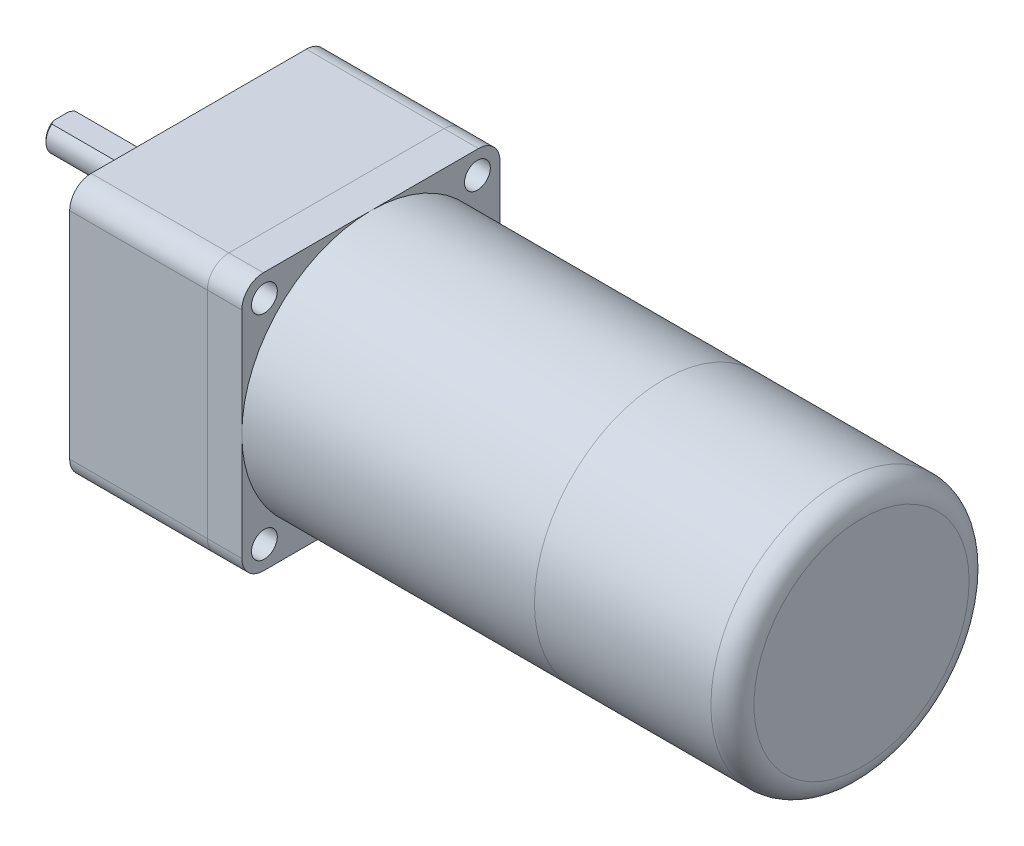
ISO-10303-21;
HEADER;
FILE_DESCRIPTION(('STEP AP214'),'2;1');
FILE_NAME('part.step','',(''),(''),'','','');
FILE_SCHEMA(('AUTOMOTIVE_DESIGN { 1 0 10303 214 1 1 1 1 }'));
ENDSEC;
DATA;
#1=APPLICATION_CONTEXT('core data for automotive mechanical design processes');
#2=APPLICATION_PROTOCOL_DEFINITION('international standard','automotive_design',2000,#1);
#3=PRODUCT_CONTEXT('',#1,'mechanical');
#4=PRODUCT('Part','Part','',(#3));
#5=PRODUCT_RELATED_PRODUCT_CATEGORY('part','',(#4));
#6=PRODUCT_DEFINITION_FORMATION('','',#4);
#7=PRODUCT_DEFINITION_CONTEXT('part definition',#1,'design');
#8=PRODUCT_DEFINITION('design','',#6,#7);
#9=PRODUCT_DEFINITION_SHAPE('','',#8);
#10=(LENGTH_UNIT() NAMED_UNIT(*) SI_UNIT(.MILLI.,.METRE.));
#11=(NAMED_UNIT(*) PLANE_ANGLE_UNIT() SI_UNIT($,.RADIAN.));
#12=(NAMED_UNIT(*) SI_UNIT($,.STERADIAN.) SOLID_ANGLE_UNIT());
#13=UNCERTAINTY_MEASURE_WITH_UNIT(LENGTH_MEASURE(1.E-05),#10,'distance_accuracy_value','');
#14=(GEOMETRIC_REPRESENTATION_CONTEXT(3) GLOBAL_UNCERTAINTY_ASSIGNED_CONTEXT((#13)) GLOBAL_UNIT_ASSIGNED_CONTEXT((#10,
#11,#12)) REPRESENTATION_CONTEXT('',''));
#15=CARTESIAN_POINT('',(0.,0.,0.));
#16=DIRECTION('',(0.,0.,1.));
#17=DIRECTION('',(1.,0.,0.));
#18=AXIS2_PLACEMENT_3D('',#15,#16,#17);
#19=CARTESIAN_POINT('',(-32.,10.,0.));
#20=DIRECTION('',(1.,0.,0.));
#21=DIRECTION('',(0.,0.,-1.));
#22=AXIS2_PLACEMENT_3D('',#19,#20,#21);
#23=CYLINDRICAL_SURFACE('',#22,4.);
#24=DIRECTION('',(-1.,0.,0.));
#25=VECTOR('',#24,1.);
#26=CARTESIAN_POINT('',(-7.,13.,2.64575131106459));
#27=LINE('',#26,#25);
#28=CARTESIAN_POINT('',(-7.,13.,2.64575131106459));
#29=VERTEX_POINT('',#28);
#30=CARTESIAN_POINT('',(-31.5,13.,2.64575131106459));
#31=VERTEX_POINT('',#30);
#32=EDGE_CURVE('E87',#29,#31,#27,.T.);
#33=ORIENTED_EDGE('',*,*,#32,.T.);
#34=CARTESIAN_POINT('',(-31.5,10.,0.));
#35=DIRECTION('',(-1.,0.,0.));
#36=DIRECTION('',(0.,0.,1.));
#37=AXIS2_PLACEMENT_3D('',#34,#35,#36);
#38=CIRCLE('',#37,4.);
#39=CARTESIAN_POINT('',(-31.5,13.,-2.64575131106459));
#40=VERTEX_POINT('',#39);
#41=EDGE_CURVE('E12',#31,#40,#38,.F.);
#42=ORIENTED_EDGE('',*,*,#41,.T.);
#43=DIRECTION('',(-1.,0.,0.));
#44=VECTOR('',#43,1.);
#45=CARTESIAN_POINT('',(-7.,13.,-2.64575131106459));
#46=LINE('',#45,#44);
#47=CARTESIAN_POINT('',(-7.,13.,-2.64575131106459));
#48=VERTEX_POINT('',#47);
#49=EDGE_CURVE('E85',#48,#40,#46,.T.);
#50=ORIENTED_EDGE('',*,*,#49,.F.);
#51=CARTESIAN_POINT('',(-7.,10.,0.));
#52=DIRECTION('',(-1.,0.,0.));
#53=DIRECTION('',(0.,0.,1.));
#54=AXIS2_PLACEMENT_3D('',#51,#52,#53);
#55=CIRCLE('',#54,4.);
#56=EDGE_CURVE('E78',#29,#48,#55,.T.);
#57=ORIENTED_EDGE('',*,*,#56,.F.);
#58=EDGE_LOOP('',(#33,#42,#50,#57));
#59=FACE_BOUND('',#58,.T.);
#60=CARTESIAN_POINT('',(-3.3,10.,0.));
#61=DIRECTION('',(-1.,0.,0.));
#62=DIRECTION('',(0.,0.,1.));
#63=AXIS2_PLACEMENT_3D('',#60,#61,#62);
#64=CIRCLE('',#63,4.);
#65=CARTESIAN_POINT('',(-3.3,10.,4.));
#66=VERTEX_POINT('',#65);
#67=EDGE_CURVE('E91',#66,#66,#64,.T.);
#68=ORIENTED_EDGE('',*,*,#67,.T.);
#69=EDGE_LOOP('',(#68));
#70=FACE_BOUND('',#69,.T.);
#71=ADVANCED_FACE('F44',(#59,#70),#23,.T.);
#72=CARTESIAN_POINT('',(-32.,10.,0.));
#73=DIRECTION('',(-1.,0.,0.));
#74=DIRECTION('',(0.,0.,1.));
#75=AXIS2_PLACEMENT_3D('',#72,#73,#74);
#76=PLANE('',#75);
#77=DIRECTION('',(0.,0.,1.));
#78=VECTOR('',#77,1.);
#79=CARTESIAN_POINT('',(-32.,13.,2.64575131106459));
#80=LINE('',#79,#78);
#81=CARTESIAN_POINT('',(-32.,13.,-1.80277563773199));
#82=VERTEX_POINT('',#81);
#83=CARTESIAN_POINT('',(-32.,13.,1.80277563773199));
#84=VERTEX_POINT('',#83);
#85=EDGE_CURVE('E82',#82,#84,#80,.T.);
#86=ORIENTED_EDGE('',*,*,#85,.F.);
#87=CARTESIAN_POINT('',(-32.,10.,0.));
#88=DIRECTION('',(-1.,0.,0.));
#89=DIRECTION('',(0.,0.,1.));
#90=AXIS2_PLACEMENT_3D('',#87,#88,#89);
#91=CIRCLE('',#90,3.5);
#92=EDGE_CURVE('E97',#82,#84,#91,.T.);
#93=ORIENTED_EDGE('',*,*,#92,.T.);
#94=EDGE_LOOP('',(#86,#93));
#95=FACE_BOUND('',#94,.T.);
#96=ADVANCED_FACE('F113',(#95),#76,.T.);
#97=CARTESIAN_POINT('',(-3.3,10.,0.));
#98=DIRECTION('',(-1.,0.,0.));
#99=DIRECTION('',(0.,0.,1.));
#100=AXIS2_PLACEMENT_3D('',#97,#98,#99);
#101=PLANE('',#100);
#102=ORIENTED_EDGE('',*,*,#67,.F.);
#103=EDGE_LOOP('',(#102));
#104=FACE_BOUND('',#103,.T.);
#105=ADVANCED_FACE('F112',(#104),#101,.F.);
#106=CARTESIAN_POINT('',(-7.,13.,2.64575131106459));
#107=DIRECTION('',(0.,-1.,0.));
#108=DIRECTION('',(0.,0.,-1.));
#109=AXIS2_PLACEMENT_3D('',#106,#107,#108);
#110=PLANE('',#109);
#111=ORIENTED_EDGE('',*,*,#85,.T.);
#112=CARTESIAN_POINT('',(-32.,13.,1.80277563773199));
#113=CARTESIAN_POINT('',(-31.962552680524,13.,1.87545495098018));
#114=CARTESIAN_POINT('',(-31.9238154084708,13.,1.94745530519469));
#115=CARTESIAN_POINT('',(-31.8441464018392,13.,2.09016482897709));
#116=CARTESIAN_POINT('',(-31.8032162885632,13.,2.16087490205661));
#117=CARTESIAN_POINT('',(-31.7194976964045,13.,2.30116567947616));
#118=CARTESIAN_POINT('',(-31.6767094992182,13.,2.37074655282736));
#119=CARTESIAN_POINT('',(-31.5895037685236,13.,2.50895192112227));
#120=CARTESIAN_POINT('',(-31.5450850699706,13.,2.57757568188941));
#121=CARTESIAN_POINT('',(-31.5,13.,2.64575131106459));
#122=B_SPLINE_CURVE_WITH_KNOTS('',3,(#112,#113,#114,#115,#116,#117,#118,#119,#120,#121),
.UNSPECIFIED.,.F.,.F.,(4,2,2,2,4),(0.,0.245246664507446,0.490314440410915,0.735345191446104,
0.980554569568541),.UNSPECIFIED.);
#123=EDGE_CURVE('E53',#84,#31,#122,.T.);
#124=ORIENTED_EDGE('',*,*,#123,.T.);
#125=ORIENTED_EDGE('',*,*,#32,.F.);
#126=DIRECTION('',(0.,0.,1.));
#127=VECTOR('',#126,1.);
#128=CARTESIAN_POINT('',(-7.,13.,2.64575131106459));
#129=LINE('',#128,#127);
#130=EDGE_CURVE('E81',#48,#29,#129,.T.);
#131=ORIENTED_EDGE('',*,*,#130,.F.);
#132=ORIENTED_EDGE('',*,*,#49,.T.);
#133=CARTESIAN_POINT('',(-31.5,13.,-2.64575131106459));
#134=CARTESIAN_POINT('',(-31.5450850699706,13.,-2.57757568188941));
#135=CARTESIAN_POINT('',(-31.5895037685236,13.,-2.50895192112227));
#136=CARTESIAN_POINT('',(-31.6767094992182,13.,-2.37074655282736));
#137=CARTESIAN_POINT('',(-31.7194976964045,13.,-2.30116567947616));
#138=CARTESIAN_POINT('',(-31.8032162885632,13.,-2.16087490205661));
#139=CARTESIAN_POINT('',(-31.8441464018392,13.,-2.09016482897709));
#140=CARTESIAN_POINT('',(-31.9238154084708,13.,-1.94745530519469));
#141=CARTESIAN_POINT('',(-31.962552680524,13.,-1.87545495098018));
#142=CARTESIAN_POINT('',(-32.,13.,-1.80277563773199));
#143=B_SPLINE_CURVE_WITH_KNOTS('',3,(#133,#134,#135,#136,#137,#138,#139,#140,#141,#142),
.UNSPECIFIED.,.F.,.F.,(4,2,2,2,4),(0.,0.245209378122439,0.490240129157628,0.735307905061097,
0.980554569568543),.UNSPECIFIED.);
#144=EDGE_CURVE('E100',#40,#82,#143,.T.);
#145=ORIENTED_EDGE('',*,*,#144,.T.);
#146=EDGE_LOOP('',(#111,#124,#125,#131,#132,#145));
#147=FACE_BOUND('',#146,.T.);
#148=ADVANCED_FACE('F84',(#147),#110,.F.);
#149=CARTESIAN_POINT('',(-7.,10.,0.));
#150=DIRECTION('',(-1.,0.,0.));
#151=DIRECTION('',(0.,0.,1.));
#152=AXIS2_PLACEMENT_3D('',#149,#150,#151);
#153=PLANE('',#152);
#154=ORIENTED_EDGE('',*,*,#56,.T.);
#155=ORIENTED_EDGE('',*,*,#130,.T.);
#156=EDGE_LOOP('',(#154,#155));
#157=FACE_BOUND('',#156,.T.);
#158=ADVANCED_FACE('F80',(#157),#153,.T.);
#159=CARTESIAN_POINT('',(-32.,10.,0.));
#160=DIRECTION('',(1.,0.,0.));
#161=DIRECTION('',(0.,0.,-1.));
#162=AXIS2_PLACEMENT_3D('',#159,#160,#161);
#163=CONICAL_SURFACE('',#162,3.5,0.785398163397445);
#164=ORIENTED_EDGE('',*,*,#144,.F.);
#165=ORIENTED_EDGE('',*,*,#41,.F.);
#166=ORIENTED_EDGE('',*,*,#123,.F.);
#167=ORIENTED_EDGE('',*,*,#92,.F.);
#168=EDGE_LOOP('',(#164,#165,#166,#167));
#169=FACE_BOUND('',#168,.T.);
#170=ADVANCED_FACE('F46',(#169),#163,.T.);
#171=CLOSED_SHELL('',(#71,#96,#105,#148,#158,#170));
#172=MANIFOLD_SOLID_BREP('B2',#171);
#173=CARTESIAN_POINT('',(-3.3,10.,0.));
#174=DIRECTION('',(1.,0.,0.));
#175=DIRECTION('',(0.,0.,-1.));
#176=AXIS2_PLACEMENT_3D('',#173,#174,#175);
#177=CYLINDRICAL_SURFACE('',#176,12.);
#178=CARTESIAN_POINT('',(-2.8,10.,0.));
#179=DIRECTION('',(-1.,0.,0.));
#180=DIRECTION('',(0.,0.,1.));
#181=AXIS2_PLACEMENT_3D('',#178,#179,#180);
#182=CIRCLE('',#181,12.);
#183=CARTESIAN_POINT('',(-2.8,10.,12.));
#184=VERTEX_POINT('',#183);
#185=EDGE_CURVE('E43',#184,#184,#182,.F.);
#186=ORIENTED_EDGE('',*,*,#185,.T.);
#187=EDGE_LOOP('',(#186));
#188=FACE_BOUND('',#187,.T.);
#189=CARTESIAN_POINT('',(0.,10.,0.));
#190=DIRECTION('',(-1.,0.,0.));
#191=DIRECTION('',(0.,0.,1.));
#192=AXIS2_PLACEMENT_3D('',#189,#190,#191);
#193=CIRCLE('',#192,12.);
#194=CARTESIAN_POINT('',(0.,10.,12.));
#195=VERTEX_POINT('',#194);
#196=EDGE_CURVE('E186',#195,#195,#193,.T.);
#197=ORIENTED_EDGE('',*,*,#196,.T.);
#198=EDGE_LOOP('',(#197));
#199=FACE_BOUND('',#198,.T.);
#200=ADVANCED_FACE('F175',(#188,#199),#177,.T.);
#201=CARTESIAN_POINT('',(-3.3,10.,0.));
#202=DIRECTION('',(-1.,0.,0.));
#203=DIRECTION('',(0.,0.,1.));
#204=AXIS2_PLACEMENT_3D('',#201,#202,#203);
#205=PLANE('',#204);
#206=CARTESIAN_POINT('',(-3.3,10.,0.));
#207=DIRECTION('',(-1.,0.,0.));
#208=DIRECTION('',(0.,0.,1.));
#209=AXIS2_PLACEMENT_3D('',#206,#207,#208);
#210=CIRCLE('',#209,11.5);
#211=CARTESIAN_POINT('',(-3.3,10.,11.5));
#212=VERTEX_POINT('',#211);
#213=EDGE_CURVE('E182',#212,#212,#210,.T.);
#214=ORIENTED_EDGE('',*,*,#213,.T.);
#215=EDGE_LOOP('',(#214));
#216=FACE_BOUND('',#215,.T.);
#217=ADVANCED_FACE('F196',(#216),#205,.T.);
#218=CARTESIAN_POINT('',(0.,10.,0.));
#219=DIRECTION('',(-1.,0.,0.));
#220=DIRECTION('',(0.,0.,1.));
#221=AXIS2_PLACEMENT_3D('',#218,#219,#220);
#222=PLANE('',#221);
#223=ORIENTED_EDGE('',*,*,#196,.F.);
#224=EDGE_LOOP('',(#223));
#225=FACE_BOUND('',#224,.T.);
#226=ADVANCED_FACE('F194',(#225),#222,.F.);
#227=CARTESIAN_POINT('',(-2.8,10.,0.));
#228=DIRECTION('',(-1.,0.,0.));
#229=DIRECTION('',(0.,0.,1.));
#230=AXIS2_PLACEMENT_3D('',#227,#228,#229);
#231=TOROIDAL_SURFACE('',#230,11.5,0.5);
#232=ORIENTED_EDGE('',*,*,#185,.F.);
#233=EDGE_LOOP('',(#232));
#234=FACE_BOUND('',#233,.T.);
#235=ORIENTED_EDGE('',*,*,#213,.F.);
#236=EDGE_LOOP('',(#235));
#237=FACE_BOUND('',#236,.T.);
#238=ADVANCED_FACE('F177',(#234,#237),#231,.T.);
#239=CLOSED_SHELL('',(#200,#217,#226,#238));
#240=MANIFOLD_SOLID_BREP('B6',#239);
#241=CARTESIAN_POINT('',(154.,0.,0.));
#242=DIRECTION('',(-1.,0.,0.));
#243=DIRECTION('',(0.,0.,1.));
#244=AXIS2_PLACEMENT_3D('',#241,#242,#243);
#245=CYLINDRICAL_SURFACE('',#244,30.);
#246=CARTESIAN_POINT('',(149.,0.,0.));
#247=DIRECTION('',(1.,0.,0.));
#248=DIRECTION('',(0.,0.,-1.));
#249=AXIS2_PLACEMENT_3D('',#246,#247,#248);
#250=CIRCLE('',#249,30.);
#251=CARTESIAN_POINT('',(149.,0.,-30.));
#252=VERTEX_POINT('',#251);
#253=EDGE_CURVE('E174',#252,#252,#250,.F.);
#254=ORIENTED_EDGE('',*,*,#253,.T.);
#255=EDGE_LOOP('',(#254));
#256=FACE_BOUND('',#255,.T.);
#257=CARTESIAN_POINT('',(108.,0.,0.));
#258=DIRECTION('',(1.,0.,0.));
#259=DIRECTION('',(0.,0.,-1.));
#260=AXIS2_PLACEMENT_3D('',#257,#258,#259);
#261=CIRCLE('',#260,30.);
#262=CARTESIAN_POINT('',(108.,0.,-30.));
#263=VERTEX_POINT('',#262);
#264=EDGE_CURVE('E250',#263,#263,#261,.T.);
#265=ORIENTED_EDGE('',*,*,#264,.T.);
#266=EDGE_LOOP('',(#265));
#267=FACE_BOUND('',#266,.T.);
#268=ADVANCED_FACE('F239',(#256,#267),#245,.T.);
#269=CARTESIAN_POINT('',(154.,0.,0.));
#270=DIRECTION('',(1.,0.,0.));
#271=DIRECTION('',(0.,0.,-1.));
#272=AXIS2_PLACEMENT_3D('',#269,#270,#271);
#273=PLANE('',#272);
#274=CARTESIAN_POINT('',(154.,0.,0.));
#275=DIRECTION('',(1.,0.,0.));
#276=DIRECTION('',(0.,0.,-1.));
#277=AXIS2_PLACEMENT_3D('',#274,#275,#276);
#278=CIRCLE('',#277,25.);
#279=CARTESIAN_POINT('',(154.,0.,-25.));
#280=VERTEX_POINT('',#279);
#281=EDGE_CURVE('E246',#280,#280,#278,.T.);
#282=ORIENTED_EDGE('',*,*,#281,.T.);
#283=EDGE_LOOP('',(#282));
#284=FACE_BOUND('',#283,.T.);
#285=ADVANCED_FACE('F260',(#284),#273,.T.);
#286=CARTESIAN_POINT('',(108.,0.,0.));
#287=DIRECTION('',(1.,0.,0.));
#288=DIRECTION('',(0.,0.,-1.));
#289=AXIS2_PLACEMENT_3D('',#286,#287,#288);
#290=PLANE('',#289);
#291=ORIENTED_EDGE('',*,*,#264,.F.);
#292=EDGE_LOOP('',(#291));
#293=FACE_BOUND('',#292,.T.);
#294=ADVANCED_FACE('F258',(#293),#290,.F.);
#295=CARTESIAN_POINT('',(149.,0.,0.));
#296=DIRECTION('',(1.,0.,0.));
#297=DIRECTION('',(0.,0.,-1.));
#298=AXIS2_PLACEMENT_3D('',#295,#296,#297);
#299=TOROIDAL_SURFACE('',#298,25.,5.);
#300=ORIENTED_EDGE('',*,*,#253,.F.);
#301=EDGE_LOOP('',(#300));
#302=FACE_BOUND('',#301,.T.);
#303=ORIENTED_EDGE('',*,*,#281,.F.);
#304=EDGE_LOOP('',(#303));
#305=FACE_BOUND('',#304,.T.);
#306=ADVANCED_FACE('F241',(#302,#305),#299,.T.);
#307=CLOSED_SHELL('',(#268,#285,#294,#306));
#308=MANIFOLD_SOLID_BREP('B38',#307);
#309=CARTESIAN_POINT('',(108.,0.,0.));
#310=DIRECTION('',(-1.,0.,0.));
#311=DIRECTION('',(0.,0.,1.));
#312=AXIS2_PLACEMENT_3D('',#309,#310,#311);
#313=CYLINDRICAL_SURFACE('',#312,30.);
#314=CARTESIAN_POINT('',(108.,0.,0.));
#315=DIRECTION('',(1.,0.,0.));
#316=DIRECTION('',(0.,0.,-1.));
#317=AXIS2_PLACEMENT_3D('',#314,#315,#316);
#318=CIRCLE('',#317,30.);
#319=CARTESIAN_POINT('',(108.,0.,-30.));
#320=VERTEX_POINT('',#319);
#321=EDGE_CURVE('E238',#320,#320,#318,.T.);
#322=ORIENTED_EDGE('',*,*,#321,.F.);
#323=EDGE_LOOP('',(#322));
#324=FACE_BOUND('',#323,.T.);
#325=CARTESIAN_POINT('',(40.,0.,0.));
#326=DIRECTION('',(1.,0.,0.));
#327=DIRECTION('',(0.,0.,-1.));
#328=AXIS2_PLACEMENT_3D('',#325,#326,#327);
#329=CIRCLE('',#328,30.);
#330=CARTESIAN_POINT('',(40.,0.,-30.));
#331=VERTEX_POINT('',#330);
#332=EDGE_CURVE('E308',#331,#331,#329,.T.);
#333=ORIENTED_EDGE('',*,*,#332,.T.);
#334=EDGE_LOOP('',(#333));
#335=FACE_BOUND('',#334,.T.);
#336=ADVANCED_FACE('F305',(#324,#335),#313,.T.);
#337=CARTESIAN_POINT('',(108.,0.,0.));
#338=DIRECTION('',(1.,0.,0.));
#339=DIRECTION('',(0.,0.,-1.));
#340=AXIS2_PLACEMENT_3D('',#337,#338,#339);
#341=PLANE('',#340);
#342=ORIENTED_EDGE('',*,*,#321,.T.);
#343=EDGE_LOOP('',(#342));
#344=FACE_BOUND('',#343,.T.);
#345=ADVANCED_FACE('F320',(#344),#341,.T.);
#346=CARTESIAN_POINT('',(40.,0.,0.));
#347=DIRECTION('',(1.,0.,0.));
#348=DIRECTION('',(0.,0.,-1.));
#349=AXIS2_PLACEMENT_3D('',#346,#347,#348);
#350=PLANE('',#349);
#351=ORIENTED_EDGE('',*,*,#332,.F.);
#352=EDGE_LOOP('',(#351));
#353=FACE_BOUND('',#352,.T.);
#354=ADVANCED_FACE('F318',(#353),#350,.F.);
#355=CLOSED_SHELL('',(#336,#345,#354));
#356=MANIFOLD_SOLID_BREP('B169',#355);
#357=CARTESIAN_POINT('',(40.,-25.,25.));
#358=DIRECTION('',(-1.,0.,0.));
#359=DIRECTION('',(0.,0.,1.));
#360=AXIS2_PLACEMENT_3D('',#357,#358,#359);
#361=CYLINDRICAL_SURFACE('',#360,5.);
#362=CARTESIAN_POINT('',(32.,-25.,25.));
#363=DIRECTION('',(1.,0.,0.));
#364=DIRECTION('',(0.,0.,1.));
#365=AXIS2_PLACEMENT_3D('',#362,#363,#364);
#366=CIRCLE('',#365,5.);
#367=CARTESIAN_POINT('',(32.,-25.,30.));
#368=VERTEX_POINT('',#367);
#369=CARTESIAN_POINT('',(32.,-30.,25.));
#370=VERTEX_POINT('',#369);
#371=EDGE_CURVE('E453',#368,#370,#366,.T.);
#372=ORIENTED_EDGE('',*,*,#371,.T.);
#373=DIRECTION('',(-1.,0.,0.));
#374=VECTOR('',#373,1.);
#375=CARTESIAN_POINT('',(40.,-30.,25.));
#376=LINE('',#375,#374);
#377=CARTESIAN_POINT('',(40.,-30.,25.));
#378=VERTEX_POINT('',#377);
#379=EDGE_CURVE('E303',#378,#370,#376,.T.);
#380=ORIENTED_EDGE('',*,*,#379,.F.);
#381=CARTESIAN_POINT('',(40.,-25.,25.));
#382=DIRECTION('',(1.,0.,0.));
#383=DIRECTION('',(0.,0.,1.));
#384=AXIS2_PLACEMENT_3D('',#381,#382,#383);
#385=CIRCLE('',#384,5.);
#386=CARTESIAN_POINT('',(40.,-25.,30.));
#387=VERTEX_POINT('',#386);
#388=EDGE_CURVE('E467',#387,#378,#385,.T.);
#389=ORIENTED_EDGE('',*,*,#388,.F.);
#390=DIRECTION('',(-1.,0.,0.));
#391=VECTOR('',#390,1.);
#392=CARTESIAN_POINT('',(40.,-25.,30.));
#393=LINE('',#392,#391);
#394=EDGE_CURVE('E449',#387,#368,#393,.T.);
#395=ORIENTED_EDGE('',*,*,#394,.T.);
#396=EDGE_LOOP('',(#372,#380,#389,#395));
#397=FACE_BOUND('',#396,.T.);
#398=ADVANCED_FACE('F355',(#397),#361,.T.);
#399=CARTESIAN_POINT('',(40.,-30.,25.));
#400=DIRECTION('',(0.,1.,0.));
#401=DIRECTION('',(0.,0.,1.));
#402=AXIS2_PLACEMENT_3D('',#399,#400,#401);
#403=PLANE('',#402);
#404=DIRECTION('',(0.,0.,-1.));
#405=VECTOR('',#404,1.);
#406=CARTESIAN_POINT('',(32.,-30.,25.));
#407=LINE('',#406,#405);
#408=CARTESIAN_POINT('',(32.,-30.,-25.));
#409=VERTEX_POINT('',#408);
#410=EDGE_CURVE('E456',#370,#409,#407,.T.);
#411=ORIENTED_EDGE('',*,*,#410,.T.);
#412=DIRECTION('',(-1.,0.,0.));
#413=VECTOR('',#412,1.);
#414=CARTESIAN_POINT('',(40.,-30.,-25.));
#415=LINE('',#414,#413);
#416=CARTESIAN_POINT('',(40.,-30.,-25.));
#417=VERTEX_POINT('',#416);
#418=EDGE_CURVE('E364',#417,#409,#415,.T.);
#419=ORIENTED_EDGE('',*,*,#418,.F.);
#420=DIRECTION('',(0.,0.,-1.));
#421=VECTOR('',#420,1.);
#422=CARTESIAN_POINT('',(40.,-30.,25.));
#423=LINE('',#422,#421);
#424=EDGE_CURVE('E416',#378,#417,#423,.T.);
#425=ORIENTED_EDGE('',*,*,#424,.F.);
#426=ORIENTED_EDGE('',*,*,#379,.T.);
#427=EDGE_LOOP('',(#411,#419,#425,#426));
#428=FACE_BOUND('',#427,.T.);
#429=ADVANCED_FACE('F521',(#428),#403,.F.);
#430=CARTESIAN_POINT('',(40.,-25.,-25.));
#431=DIRECTION('',(-1.,0.,0.));
#432=DIRECTION('',(0.,0.,1.));
#433=AXIS2_PLACEMENT_3D('',#430,#431,#432);
#434=CYLINDRICAL_SURFACE('',#433,5.);
#435=CARTESIAN_POINT('',(32.,-25.,-25.));
#436=DIRECTION('',(1.,0.,0.));
#437=DIRECTION('',(0.,0.,-1.));
#438=AXIS2_PLACEMENT_3D('',#435,#436,#437);
#439=CIRCLE('',#438,5.);
#440=CARTESIAN_POINT('',(32.,-25.,-30.));
#441=VERTEX_POINT('',#440);
#442=EDGE_CURVE('E458',#409,#441,#439,.T.);
#443=ORIENTED_EDGE('',*,*,#442,.T.);
#444=DIRECTION('',(-1.,0.,0.));
#445=VECTOR('',#444,1.);
#446=CARTESIAN_POINT('',(40.,-25.,-30.));
#447=LINE('',#446,#445);
#448=CARTESIAN_POINT('',(40.,-25.,-30.));
#449=VERTEX_POINT('',#448);
#450=EDGE_CURVE('E474',#449,#441,#447,.T.);
#451=ORIENTED_EDGE('',*,*,#450,.F.);
#452=CARTESIAN_POINT('',(40.,-25.,-25.));
#453=DIRECTION('',(1.,0.,0.));
#454=DIRECTION('',(0.,0.,-1.));
#455=AXIS2_PLACEMENT_3D('',#452,#453,#454);
#456=CIRCLE('',#455,5.);
#457=EDGE_CURVE('E622',#417,#449,#456,.T.);
#458=ORIENTED_EDGE('',*,*,#457,.F.);
#459=ORIENTED_EDGE('',*,*,#418,.T.);
#460=EDGE_LOOP('',(#443,#451,#458,#459));
#461=FACE_BOUND('',#460,.T.);
#462=ADVANCED_FACE('F525',(#461),#434,.T.);
#463=CARTESIAN_POINT('',(40.,-25.,-30.));
#464=DIRECTION('',(0.,0.,1.));
#465=DIRECTION('',(1.,0.,0.));
#466=AXIS2_PLACEMENT_3D('',#463,#464,#465);
#467=PLANE('',#466);
#468=DIRECTION('',(0.,1.,0.));
#469=VECTOR('',#468,1.);
#470=CARTESIAN_POINT('',(32.,-25.,-30.));
#471=LINE('',#470,#469);
#472=CARTESIAN_POINT('',(32.,25.,-30.));
#473=VERTEX_POINT('',#472);
#474=EDGE_CURVE('E460',#441,#473,#471,.T.);
#475=ORIENTED_EDGE('',*,*,#474,.T.);
#476=DIRECTION('',(-1.,0.,0.));
#477=VECTOR('',#476,1.);
#478=CARTESIAN_POINT('',(40.,25.,-30.));
#479=LINE('',#478,#477);
#480=CARTESIAN_POINT('',(40.,25.,-30.));
#481=VERTEX_POINT('',#480);
#482=EDGE_CURVE('E471',#481,#473,#479,.T.);
#483=ORIENTED_EDGE('',*,*,#482,.F.);
#484=DIRECTION('',(0.,1.,0.));
#485=VECTOR('',#484,1.);
#486=CARTESIAN_POINT('',(40.,-25.,-30.));
#487=LINE('',#486,#485);
#488=EDGE_CURVE('E624',#449,#481,#487,.T.);
#489=ORIENTED_EDGE('',*,*,#488,.F.);
#490=ORIENTED_EDGE('',*,*,#450,.T.);
#491=EDGE_LOOP('',(#475,#483,#489,#490));
#492=FACE_BOUND('',#491,.T.);
#493=ADVANCED_FACE('F529',(#492),#467,.F.);
#494=CARTESIAN_POINT('',(40.,25.,-25.));
#495=DIRECTION('',(-1.,0.,0.));
#496=DIRECTION('',(0.,0.,1.));
#497=AXIS2_PLACEMENT_3D('',#494,#495,#496);
#498=CYLINDRICAL_SURFACE('',#497,5.);
#499=CARTESIAN_POINT('',(32.,25.,-25.));
#500=DIRECTION('',(1.,0.,0.));
#501=DIRECTION('',(0.,0.,1.));
#502=AXIS2_PLACEMENT_3D('',#499,#500,#501);
#503=CIRCLE('',#502,5.);
#504=CARTESIAN_POINT('',(32.,30.,-25.));
#505=VERTEX_POINT('',#504);
#506=EDGE_CURVE('E462',#473,#505,#503,.T.);
#507=ORIENTED_EDGE('',*,*,#506,.T.);
#508=DIRECTION('',(-1.,0.,0.));
#509=VECTOR('',#508,1.);
#510=CARTESIAN_POINT('',(40.,30.,-25.));
#511=LINE('',#510,#509);
#512=CARTESIAN_POINT('',(40.,30.,-25.));
#513=VERTEX_POINT('',#512);
#514=EDGE_CURVE('E444',#513,#505,#511,.T.);
#515=ORIENTED_EDGE('',*,*,#514,.F.);
#516=CARTESIAN_POINT('',(40.,25.,-25.));
#517=DIRECTION('',(1.,0.,0.));
#518=DIRECTION('',(0.,0.,1.));
#519=AXIS2_PLACEMENT_3D('',#516,#517,#518);
#520=CIRCLE('',#519,5.);
#521=EDGE_CURVE('E435',#481,#513,#520,.T.);
#522=ORIENTED_EDGE('',*,*,#521,.F.);
#523=ORIENTED_EDGE('',*,*,#482,.T.);
#524=EDGE_LOOP('',(#507,#515,#522,#523));
#525=FACE_BOUND('',#524,.T.);
#526=ADVANCED_FACE('F535',(#525),#498,.T.);
#527=CARTESIAN_POINT('',(40.,30.,25.));
#528=DIRECTION('',(0.,-1.,0.));
#529=DIRECTION('',(0.,0.,-1.));
#530=AXIS2_PLACEMENT_3D('',#527,#528,#529);
#531=PLANE('',#530);
#532=DIRECTION('',(0.,0.,1.));
#533=VECTOR('',#532,1.);
#534=CARTESIAN_POINT('',(32.,30.,25.));
#535=LINE('',#534,#533);
#536=CARTESIAN_POINT('',(32.,30.,25.));
#537=VERTEX_POINT('',#536);
#538=EDGE_CURVE('E443',#505,#537,#535,.T.);
#539=ORIENTED_EDGE('',*,*,#538,.T.);
#540=DIRECTION('',(-1.,0.,0.));
#541=VECTOR('',#540,1.);
#542=CARTESIAN_POINT('',(40.,30.,25.));
#543=LINE('',#542,#541);
#544=CARTESIAN_POINT('',(40.,30.,25.));
#545=VERTEX_POINT('',#544);
#546=EDGE_CURVE('E440',#545,#537,#543,.T.);
#547=ORIENTED_EDGE('',*,*,#546,.F.);
#548=DIRECTION('',(0.,0.,1.));
#549=VECTOR('',#548,1.);
#550=CARTESIAN_POINT('',(40.,30.,25.));
#551=LINE('',#550,#549);
#552=EDGE_CURVE('E429',#513,#545,#551,.T.);
#553=ORIENTED_EDGE('',*,*,#552,.F.);
#554=ORIENTED_EDGE('',*,*,#514,.T.);
#555=EDGE_LOOP('',(#539,#547,#553,#554));
#556=FACE_BOUND('',#555,.T.);
#557=ADVANCED_FACE('F441',(#556),#531,.F.);
#558=CARTESIAN_POINT('',(40.,25.,25.));
#559=DIRECTION('',(-1.,0.,0.));
#560=DIRECTION('',(0.,0.,1.));
#561=AXIS2_PLACEMENT_3D('',#558,#559,#560);
#562=CYLINDRICAL_SURFACE('',#561,5.);
#563=CARTESIAN_POINT('',(32.,25.,25.));
#564=DIRECTION('',(1.,0.,0.));
#565=DIRECTION('',(0.,0.,1.));
#566=AXIS2_PLACEMENT_3D('',#563,#564,#565);
#567=CIRCLE('',#566,5.);
#568=CARTESIAN_POINT('',(32.,25.,30.));
#569=VERTEX_POINT('',#568);
#570=EDGE_CURVE('E402',#537,#569,#567,.T.);
#571=ORIENTED_EDGE('',*,*,#570,.T.);
#572=DIRECTION('',(-1.,0.,0.));
#573=VECTOR('',#572,1.);
#574=CARTESIAN_POINT('',(40.,25.,30.));
#575=LINE('',#574,#573);
#576=CARTESIAN_POINT('',(40.,25.,30.));
#577=VERTEX_POINT('',#576);
#578=EDGE_CURVE('E445',#577,#569,#575,.T.);
#579=ORIENTED_EDGE('',*,*,#578,.F.);
#580=CARTESIAN_POINT('',(40.,25.,25.));
#581=DIRECTION('',(1.,0.,0.));
#582=DIRECTION('',(0.,0.,1.));
#583=AXIS2_PLACEMENT_3D('',#580,#581,#582);
#584=CIRCLE('',#583,5.);
#585=EDGE_CURVE('E433',#545,#577,#584,.T.);
#586=ORIENTED_EDGE('',*,*,#585,.F.);
#587=ORIENTED_EDGE('',*,*,#546,.T.);
#588=EDGE_LOOP('',(#571,#579,#586,#587));
#589=FACE_BOUND('',#588,.T.);
#590=ADVANCED_FACE('F447',(#589),#562,.T.);
#591=CARTESIAN_POINT('',(40.,-25.,30.));
#592=DIRECTION('',(0.,0.,-1.));
#593=DIRECTION('',(-1.,0.,0.));
#594=AXIS2_PLACEMENT_3D('',#591,#592,#593);
#595=PLANE('',#594);
#596=DIRECTION('',(0.,-1.,0.));
#597=VECTOR('',#596,1.);
#598=CARTESIAN_POINT('',(32.,-25.,30.));
#599=LINE('',#598,#597);
#600=EDGE_CURVE('E408',#569,#368,#599,.T.);
#601=ORIENTED_EDGE('',*,*,#600,.T.);
#602=ORIENTED_EDGE('',*,*,#394,.F.);
#603=DIRECTION('',(0.,-1.,0.));
#604=VECTOR('',#603,1.);
#605=CARTESIAN_POINT('',(40.,-25.,30.));
#606=LINE('',#605,#604);
#607=EDGE_CURVE('E373',#577,#387,#606,.T.);
#608=ORIENTED_EDGE('',*,*,#607,.F.);
#609=ORIENTED_EDGE('',*,*,#578,.T.);
#610=EDGE_LOOP('',(#601,#602,#608,#609));
#611=FACE_BOUND('',#610,.T.);
#612=ADVANCED_FACE('F510',(#611),#595,.F.);
#613=CARTESIAN_POINT('',(40.,-25.,25.));
#614=DIRECTION('',(-1.,0.,0.));
#615=DIRECTION('',(0.,0.,1.));
#616=AXIS2_PLACEMENT_3D('',#613,#614,#615);
#617=PLANE('',#616);
#618=CARTESIAN_POINT('',(40.,24.7487373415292,24.7487373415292));
#619=DIRECTION('',(1.,0.,0.));
#620=DIRECTION('',(0.,0.,-1.));
#621=AXIS2_PLACEMENT_3D('',#618,#619,#620);
#622=CIRCLE('',#621,3.);
#623=CARTESIAN_POINT('',(40.,24.7487373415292,21.7487373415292));
#624=VERTEX_POINT('',#623);
#625=EDGE_CURVE('E483',#624,#624,#622,.T.);
#626=ORIENTED_EDGE('',*,*,#625,.F.);
#627=EDGE_LOOP('',(#626));
#628=FACE_BOUND('',#627,.T.);
#629=CARTESIAN_POINT('',(40.,24.7487373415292,-24.7487373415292));
#630=DIRECTION('',(1.,0.,0.));
#631=DIRECTION('',(0.,0.,-1.));
#632=AXIS2_PLACEMENT_3D('',#629,#630,#631);
#633=CIRCLE('',#632,3.);
#634=CARTESIAN_POINT('',(40.,24.7487373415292,-27.7487373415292));
#635=VERTEX_POINT('',#634);
#636=EDGE_CURVE('E608',#635,#635,#633,.T.);
#637=ORIENTED_EDGE('',*,*,#636,.F.);
#638=EDGE_LOOP('',(#637));
#639=FACE_BOUND('',#638,.T.);
#640=CARTESIAN_POINT('',(40.,-24.7487373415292,-24.7487373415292));
#641=DIRECTION('',(1.,0.,0.));
#642=DIRECTION('',(0.,0.,-1.));
#643=AXIS2_PLACEMENT_3D('',#640,#641,#642);
#644=CIRCLE('',#643,3.);
#645=CARTESIAN_POINT('',(40.,-24.7487373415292,-27.7487373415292));
#646=VERTEX_POINT('',#645);
#647=EDGE_CURVE('E610',#646,#646,#644,.T.);
#648=ORIENTED_EDGE('',*,*,#647,.F.);
#649=EDGE_LOOP('',(#648));
#650=FACE_BOUND('',#649,.T.);
#651=CARTESIAN_POINT('',(40.,-24.7487373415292,24.7487373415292));
#652=DIRECTION('',(1.,0.,0.));
#653=DIRECTION('',(0.,0.,-1.));
#654=AXIS2_PLACEMENT_3D('',#651,#652,#653);
#655=CIRCLE('',#654,3.);
#656=CARTESIAN_POINT('',(40.,-24.7487373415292,21.7487373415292));
#657=VERTEX_POINT('',#656);
#658=EDGE_CURVE('E615',#657,#657,#655,.T.);
#659=ORIENTED_EDGE('',*,*,#658,.F.);
#660=EDGE_LOOP('',(#659));
#661=FACE_BOUND('',#660,.T.);
#662=ORIENTED_EDGE('',*,*,#388,.T.);
#663=ORIENTED_EDGE('',*,*,#424,.T.);
#664=ORIENTED_EDGE('',*,*,#457,.T.);
#665=ORIENTED_EDGE('',*,*,#488,.T.);
#666=ORIENTED_EDGE('',*,*,#521,.T.);
#667=ORIENTED_EDGE('',*,*,#552,.T.);
#668=ORIENTED_EDGE('',*,*,#585,.T.);
#669=ORIENTED_EDGE('',*,*,#607,.T.);
#670=EDGE_LOOP('',(#662,#663,#664,#665,#666,#667,#668,#669));
#671=FACE_BOUND('',#670,.T.);
#672=ADVANCED_FACE('F431',(#628,#639,#650,#661,#671),#617,.F.);
#673=CARTESIAN_POINT('',(32.,-25.,25.));
#674=DIRECTION('',(-1.,0.,0.));
#675=DIRECTION('',(0.,0.,1.));
#676=AXIS2_PLACEMENT_3D('',#673,#674,#675);
#677=PLANE('',#676);
#678=CARTESIAN_POINT('',(32.,24.7487373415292,24.7487373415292));
#679=DIRECTION('',(-1.,0.,0.));
#680=DIRECTION('',(0.,0.,1.));
#681=AXIS2_PLACEMENT_3D('',#678,#679,#680);
#682=CIRCLE('',#681,3.);
#683=CARTESIAN_POINT('',(32.,24.7487373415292,21.7487373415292));
#684=VERTEX_POINT('',#683);
#685=EDGE_CURVE('E358',#684,#684,#682,.T.);
#686=ORIENTED_EDGE('',*,*,#685,.F.);
#687=EDGE_LOOP('',(#686));
#688=FACE_BOUND('',#687,.T.);
#689=CARTESIAN_POINT('',(32.,24.7487373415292,-24.7487373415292));
#690=DIRECTION('',(-1.,0.,0.));
#691=DIRECTION('',(0.,0.,1.));
#692=AXIS2_PLACEMENT_3D('',#689,#690,#691);
#693=CIRCLE('',#692,3.);
#694=CARTESIAN_POINT('',(32.,24.7487373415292,-27.7487373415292));
#695=VERTEX_POINT('',#694);
#696=EDGE_CURVE('E485',#695,#695,#693,.T.);
#697=ORIENTED_EDGE('',*,*,#696,.F.);
#698=EDGE_LOOP('',(#697));
#699=FACE_BOUND('',#698,.T.);
#700=CARTESIAN_POINT('',(32.,-24.7487373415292,-24.7487373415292));
#701=DIRECTION('',(-1.,0.,0.));
#702=DIRECTION('',(0.,0.,1.));
#703=AXIS2_PLACEMENT_3D('',#700,#701,#702);
#704=CIRCLE('',#703,3.);
#705=CARTESIAN_POINT('',(32.,-24.7487373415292,-27.7487373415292));
#706=VERTEX_POINT('',#705);
#707=EDGE_CURVE('E482',#706,#706,#704,.T.);
#708=ORIENTED_EDGE('',*,*,#707,.F.);
#709=EDGE_LOOP('',(#708));
#710=FACE_BOUND('',#709,.T.);
#711=CARTESIAN_POINT('',(32.,-24.7487373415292,24.7487373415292));
#712=DIRECTION('',(-1.,0.,0.));
#713=DIRECTION('',(0.,0.,1.));
#714=AXIS2_PLACEMENT_3D('',#711,#712,#713);
#715=CIRCLE('',#714,3.);
#716=CARTESIAN_POINT('',(32.,-24.7487373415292,21.7487373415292));
#717=VERTEX_POINT('',#716);
#718=EDGE_CURVE('E479',#717,#717,#715,.T.);
#719=ORIENTED_EDGE('',*,*,#718,.F.);
#720=EDGE_LOOP('',(#719));
#721=FACE_BOUND('',#720,.T.);
#722=ORIENTED_EDGE('',*,*,#371,.F.);
#723=ORIENTED_EDGE('',*,*,#600,.F.);
#724=ORIENTED_EDGE('',*,*,#570,.F.);
#725=ORIENTED_EDGE('',*,*,#538,.F.);
#726=ORIENTED_EDGE('',*,*,#506,.F.);
#727=ORIENTED_EDGE('',*,*,#474,.F.);
#728=ORIENTED_EDGE('',*,*,#442,.F.);
#729=ORIENTED_EDGE('',*,*,#410,.F.);
#730=EDGE_LOOP('',(#722,#723,#724,#725,#726,#727,#728,#729));
#731=FACE_BOUND('',#730,.T.);
#732=ADVANCED_FACE('F495',(#688,#699,#710,#721,#731),#677,.T.);
#733=CARTESIAN_POINT('',(11.5,-24.7487373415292,24.7487373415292));
#734=DIRECTION('',(1.,0.,0.));
#735=DIRECTION('',(0.,0.,-1.));
#736=AXIS2_PLACEMENT_3D('',#733,#734,#735);
#737=CYLINDRICAL_SURFACE('',#736,3.);
#738=CARTESIAN_POINT('',(32.,-24.7487373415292,21.7487373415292));
#739=CARTESIAN_POINT('',(32.0833333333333,-24.7487373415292,21.7487373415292));
#740=CARTESIAN_POINT('',(32.1666666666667,-24.7487373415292,21.7487373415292));
#741=CARTESIAN_POINT('',(32.3333333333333,-24.7487373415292,21.7487373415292));
#742=CARTESIAN_POINT('',(32.4166666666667,-24.7487373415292,21.7487373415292));
#743=CARTESIAN_POINT('',(32.5833333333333,-24.7487373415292,21.7487373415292));
#744=CARTESIAN_POINT('',(32.6666666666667,-24.7487373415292,21.7487373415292));
#745=CARTESIAN_POINT('',(32.8333333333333,-24.7487373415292,21.7487373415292));
#746=CARTESIAN_POINT('',(32.9166666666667,-24.7487373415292,21.7487373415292));
#747=CARTESIAN_POINT('',(33.0833333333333,-24.7487373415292,21.7487373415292));
#748=CARTESIAN_POINT('',(33.1666666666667,-24.7487373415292,21.7487373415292));
#749=CARTESIAN_POINT('',(33.3333333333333,-24.7487373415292,21.7487373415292));
#750=CARTESIAN_POINT('',(33.4166666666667,-24.7487373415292,21.7487373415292));
#751=CARTESIAN_POINT('',(33.5833333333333,-24.7487373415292,21.7487373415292));
#752=CARTESIAN_POINT('',(33.6666666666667,-24.7487373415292,21.7487373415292));
#753=CARTESIAN_POINT('',(33.8333333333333,-24.7487373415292,21.7487373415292));
#754=CARTESIAN_POINT('',(33.9166666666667,-24.7487373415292,21.7487373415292));
#755=CARTESIAN_POINT('',(34.0833333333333,-24.7487373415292,21.7487373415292));
#756=CARTESIAN_POINT('',(34.1666666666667,-24.7487373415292,21.7487373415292));
#757=CARTESIAN_POINT('',(34.3333333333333,-24.7487373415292,21.7487373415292));
#758=CARTESIAN_POINT('',(34.4166666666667,-24.7487373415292,21.7487373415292));
#759=CARTESIAN_POINT('',(34.5833333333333,-24.7487373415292,21.7487373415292));
#760=CARTESIAN_POINT('',(34.6666666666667,-24.7487373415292,21.7487373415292));
#761=CARTESIAN_POINT('',(34.8333333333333,-24.7487373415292,21.7487373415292));
#762=CARTESIAN_POINT('',(34.9166666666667,-24.7487373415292,21.7487373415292));
#763=CARTESIAN_POINT('',(35.0833333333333,-24.7487373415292,21.7487373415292));
#764=CARTESIAN_POINT('',(35.1666666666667,-24.7487373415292,21.7487373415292));
#765=CARTESIAN_POINT('',(35.3333333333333,-24.7487373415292,21.7487373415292));
#766=CARTESIAN_POINT('',(35.4166666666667,-24.7487373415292,21.7487373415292));
#767=CARTESIAN_POINT('',(35.5833333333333,-24.7487373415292,21.7487373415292));
#768=CARTESIAN_POINT('',(35.6666666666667,-24.7487373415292,21.7487373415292));
#769=CARTESIAN_POINT('',(35.8333333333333,-24.7487373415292,21.7487373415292));
#770=CARTESIAN_POINT('',(35.9166666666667,-24.7487373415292,21.7487373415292));
#771=CARTESIAN_POINT('',(36.0833333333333,-24.7487373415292,21.7487373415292));
#772=CARTESIAN_POINT('',(36.1666666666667,-24.7487373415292,21.7487373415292));
#773=CARTESIAN_POINT('',(36.3333333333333,-24.7487373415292,21.7487373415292));
#774=CARTESIAN_POINT('',(36.4166666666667,-24.7487373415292,21.7487373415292));
#775=CARTESIAN_POINT('',(36.5833333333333,-24.7487373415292,21.7487373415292));
#776=CARTESIAN_POINT('',(36.6666666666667,-24.7487373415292,21.7487373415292));
#777=CARTESIAN_POINT('',(36.8333333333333,-24.7487373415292,21.7487373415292));
#778=CARTESIAN_POINT('',(36.9166666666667,-24.7487373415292,21.7487373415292));
#779=CARTESIAN_POINT('',(37.0833333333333,-24.7487373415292,21.7487373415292));
#780=CARTESIAN_POINT('',(37.1666666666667,-24.7487373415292,21.7487373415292));
#781=CARTESIAN_POINT('',(37.3333333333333,-24.7487373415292,21.7487373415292));
#782=CARTESIAN_POINT('',(37.4166666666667,-24.7487373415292,21.7487373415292));
#783=CARTESIAN_POINT('',(37.5833333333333,-24.7487373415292,21.7487373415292));
#784=CARTESIAN_POINT('',(37.6666666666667,-24.7487373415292,21.7487373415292));
#785=CARTESIAN_POINT('',(37.8333333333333,-24.7487373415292,21.7487373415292));
#786=CARTESIAN_POINT('',(37.9166666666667,-24.7487373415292,21.7487373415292));
#787=CARTESIAN_POINT('',(38.0833333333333,-24.7487373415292,21.7487373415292));
#788=CARTESIAN_POINT('',(38.1666666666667,-24.7487373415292,21.7487373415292));
#789=CARTESIAN_POINT('',(38.3333333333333,-24.7487373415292,21.7487373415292));
#790=CARTESIAN_POINT('',(38.4166666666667,-24.7487373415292,21.7487373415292));
#791=CARTESIAN_POINT('',(38.5833333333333,-24.7487373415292,21.7487373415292));
#792=CARTESIAN_POINT('',(38.6666666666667,-24.7487373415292,21.7487373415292));
#793=CARTESIAN_POINT('',(38.8333333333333,-24.7487373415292,21.7487373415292));
#794=CARTESIAN_POINT('',(38.9166666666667,-24.7487373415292,21.7487373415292));
#795=CARTESIAN_POINT('',(39.0833333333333,-24.7487373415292,21.7487373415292));
#796=CARTESIAN_POINT('',(39.1666666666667,-24.7487373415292,21.7487373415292));
#797=CARTESIAN_POINT('',(39.3333333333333,-24.7487373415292,21.7487373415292));
#798=CARTESIAN_POINT('',(39.4166666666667,-24.7487373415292,21.7487373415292));
#799=CARTESIAN_POINT('',(39.5833333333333,-24.7487373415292,21.7487373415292));
#800=CARTESIAN_POINT('',(39.6666666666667,-24.7487373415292,21.7487373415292));
#801=CARTESIAN_POINT('',(39.8333333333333,-24.7487373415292,21.7487373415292));
#802=CARTESIAN_POINT('',(39.9166666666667,-24.7487373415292,21.7487373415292));
#803=CARTESIAN_POINT('',(40.,-24.7487373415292,21.7487373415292));
#804=B_SPLINE_CURVE_WITH_KNOTS('',3,(#738,#739,#740,#741,#742,#743,#744,#745,#746,#747,#748,
#749,#750,#751,#752,#753,#754,#755,#756,#757,#758,#759,#760,#761,#762,#763,#764,#765,#766,#767,
#768,#769,#770,#771,#772,#773,#774,#775,#776,#777,#778,#779,#780,#781,#782,#783,#784,#785,#786,
#787,#788,#789,#790,#791,#792,#793,#794,#795,#796,#797,#798,#799,#800,#801,#802,#803),
.UNSPECIFIED.,.F.,.F.,(4,2,2,2,2,2,2,2,2,2,2,2,2,2,2,2,2,2,2,2,2,2,2,2,2,2,2,2,2,2,2,2,4),(0.,
0.25,0.5,0.750000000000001,1.,1.24999999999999,1.49999999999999,1.74999999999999,
1.99999999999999,2.25,2.5,2.75,3.,3.25,3.5,3.75,4.,4.25,4.5,4.75,5.,5.25,5.5,5.75,6.,6.25,6.5,
6.74999999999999,6.99999999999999,7.24999999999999,7.49999999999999,7.74999999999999,
7.99999999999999),.UNSPECIFIED.);
#805=EDGE_CURVE('BSEAM498',#717,#657,#804,.T.);
#806=ORIENTED_EDGE('',*,*,#718,.T.);
#807=ORIENTED_EDGE('',*,*,#658,.T.);
#808=ORIENTED_EDGE('',*,*,#805,.T.);
#809=ORIENTED_EDGE('',*,*,#805,.F.);
#810=EDGE_LOOP('',(#806,#808,#807,#809));
#811=FACE_BOUND('',#810,.T.);
#812=ADVANCED_FACE('F498',(#811),#737,.F.);
#813=CARTESIAN_POINT('',(11.5,-24.7487373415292,-24.7487373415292));
#814=DIRECTION('',(1.,0.,0.));
#815=DIRECTION('',(0.,0.,-1.));
#816=AXIS2_PLACEMENT_3D('',#813,#814,#815);
#817=CYLINDRICAL_SURFACE('',#816,3.);
#818=CARTESIAN_POINT('',(32.,-24.7487373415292,-27.7487373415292));
#819=CARTESIAN_POINT('',(32.0833333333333,-24.7487373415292,-27.7487373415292));
#820=CARTESIAN_POINT('',(32.1666666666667,-24.7487373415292,-27.7487373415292));
#821=CARTESIAN_POINT('',(32.3333333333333,-24.7487373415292,-27.7487373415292));
#822=CARTESIAN_POINT('',(32.4166666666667,-24.7487373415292,-27.7487373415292));
#823=CARTESIAN_POINT('',(32.5833333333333,-24.7487373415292,-27.7487373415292));
#824=CARTESIAN_POINT('',(32.6666666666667,-24.7487373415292,-27.7487373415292));
#825=CARTESIAN_POINT('',(32.8333333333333,-24.7487373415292,-27.7487373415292));
#826=CARTESIAN_POINT('',(32.9166666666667,-24.7487373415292,-27.7487373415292));
#827=CARTESIAN_POINT('',(33.0833333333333,-24.7487373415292,-27.7487373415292));
#828=CARTESIAN_POINT('',(33.1666666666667,-24.7487373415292,-27.7487373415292));
#829=CARTESIAN_POINT('',(33.3333333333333,-24.7487373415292,-27.7487373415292));
#830=CARTESIAN_POINT('',(33.4166666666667,-24.7487373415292,-27.7487373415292));
#831=CARTESIAN_POINT('',(33.5833333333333,-24.7487373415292,-27.7487373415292));
#832=CARTESIAN_POINT('',(33.6666666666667,-24.7487373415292,-27.7487373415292));
#833=CARTESIAN_POINT('',(33.8333333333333,-24.7487373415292,-27.7487373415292));
#834=CARTESIAN_POINT('',(33.9166666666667,-24.7487373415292,-27.7487373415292));
#835=CARTESIAN_POINT('',(34.0833333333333,-24.7487373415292,-27.7487373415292));
#836=CARTESIAN_POINT('',(34.1666666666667,-24.7487373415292,-27.7487373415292));
#837=CARTESIAN_POINT('',(34.3333333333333,-24.7487373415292,-27.7487373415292));
#838=CARTESIAN_POINT('',(34.4166666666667,-24.7487373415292,-27.7487373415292));
#839=CARTESIAN_POINT('',(34.5833333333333,-24.7487373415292,-27.7487373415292));
#840=CARTESIAN_POINT('',(34.6666666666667,-24.7487373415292,-27.7487373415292));
#841=CARTESIAN_POINT('',(34.8333333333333,-24.7487373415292,-27.7487373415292));
#842=CARTESIAN_POINT('',(34.9166666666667,-24.7487373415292,-27.7487373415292));
#843=CARTESIAN_POINT('',(35.0833333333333,-24.7487373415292,-27.7487373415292));
#844=CARTESIAN_POINT('',(35.1666666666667,-24.7487373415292,-27.7487373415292));
#845=CARTESIAN_POINT('',(35.3333333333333,-24.7487373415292,-27.7487373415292));
#846=CARTESIAN_POINT('',(35.4166666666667,-24.7487373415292,-27.7487373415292));
#847=CARTESIAN_POINT('',(35.5833333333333,-24.7487373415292,-27.7487373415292));
#848=CARTESIAN_POINT('',(35.6666666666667,-24.7487373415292,-27.7487373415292));
#849=CARTESIAN_POINT('',(35.8333333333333,-24.7487373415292,-27.7487373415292));
#850=CARTESIAN_POINT('',(35.9166666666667,-24.7487373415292,-27.7487373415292));
#851=CARTESIAN_POINT('',(36.0833333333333,-24.7487373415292,-27.7487373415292));
#852=CARTESIAN_POINT('',(36.1666666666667,-24.7487373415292,-27.7487373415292));
#853=CARTESIAN_POINT('',(36.3333333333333,-24.7487373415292,-27.7487373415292));
#854=CARTESIAN_POINT('',(36.4166666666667,-24.7487373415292,-27.7487373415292));
#855=CARTESIAN_POINT('',(36.5833333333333,-24.7487373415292,-27.7487373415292));
#856=CARTESIAN_POINT('',(36.6666666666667,-24.7487373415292,-27.7487373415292));
#857=CARTESIAN_POINT('',(36.8333333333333,-24.7487373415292,-27.7487373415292));
#858=CARTESIAN_POINT('',(36.9166666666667,-24.7487373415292,-27.7487373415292));
#859=CARTESIAN_POINT('',(37.0833333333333,-24.7487373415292,-27.7487373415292));
#860=CARTESIAN_POINT('',(37.1666666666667,-24.7487373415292,-27.7487373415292));
#861=CARTESIAN_POINT('',(37.3333333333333,-24.7487373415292,-27.7487373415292));
#862=CARTESIAN_POINT('',(37.4166666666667,-24.7487373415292,-27.7487373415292));
#863=CARTESIAN_POINT('',(37.5833333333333,-24.7487373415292,-27.7487373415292));
#864=CARTESIAN_POINT('',(37.6666666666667,-24.7487373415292,-27.7487373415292));
#865=CARTESIAN_POINT('',(37.8333333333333,-24.7487373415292,-27.7487373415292));
#866=CARTESIAN_POINT('',(37.9166666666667,-24.7487373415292,-27.7487373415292));
#867=CARTESIAN_POINT('',(38.0833333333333,-24.7487373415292,-27.7487373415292));
#868=CARTESIAN_POINT('',(38.1666666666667,-24.7487373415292,-27.7487373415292));
#869=CARTESIAN_POINT('',(38.3333333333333,-24.7487373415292,-27.7487373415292));
#870=CARTESIAN_POINT('',(38.4166666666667,-24.7487373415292,-27.7487373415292));
#871=CARTESIAN_POINT('',(38.5833333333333,-24.7487373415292,-27.7487373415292));
#872=CARTESIAN_POINT('',(38.6666666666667,-24.7487373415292,-27.7487373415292));
#873=CARTESIAN_POINT('',(38.8333333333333,-24.7487373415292,-27.7487373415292));
#874=CARTESIAN_POINT('',(38.9166666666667,-24.7487373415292,-27.7487373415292));
#875=CARTESIAN_POINT('',(39.0833333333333,-24.7487373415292,-27.7487373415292));
#876=CARTESIAN_POINT('',(39.1666666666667,-24.7487373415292,-27.7487373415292));
#877=CARTESIAN_POINT('',(39.3333333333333,-24.7487373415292,-27.7487373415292));
#878=CARTESIAN_POINT('',(39.4166666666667,-24.7487373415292,-27.7487373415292));
#879=CARTESIAN_POINT('',(39.5833333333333,-24.7487373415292,-27.7487373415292));
#880=CARTESIAN_POINT('',(39.6666666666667,-24.7487373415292,-27.7487373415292));
#881=CARTESIAN_POINT('',(39.8333333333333,-24.7487373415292,-27.7487373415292));
#882=CARTESIAN_POINT('',(39.9166666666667,-24.7487373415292,-27.7487373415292));
#883=CARTESIAN_POINT('',(40.,-24.7487373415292,-27.7487373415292));
#884=B_SPLINE_CURVE_WITH_KNOTS('',3,(#818,#819,#820,#821,#822,#823,#824,#825,#826,#827,#828,
#829,#830,#831,#832,#833,#834,#835,#836,#837,#838,#839,#840,#841,#842,#843,#844,#845,#846,#847,
#848,#849,#850,#851,#852,#853,#854,#855,#856,#857,#858,#859,#860,#861,#862,#863,#864,#865,#866,
#867,#868,#869,#870,#871,#872,#873,#874,#875,#876,#877,#878,#879,#880,#881,#882,#883),
.UNSPECIFIED.,.F.,.F.,(4,2,2,2,2,2,2,2,2,2,2,2,2,2,2,2,2,2,2,2,2,2,2,2,2,2,2,2,2,2,2,2,4),(0.,
0.25,0.5,0.750000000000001,1.,1.24999999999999,1.49999999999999,1.74999999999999,
1.99999999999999,2.25,2.5,2.75,3.,3.25,3.5,3.75,4.,4.25,4.5,4.75,5.,5.25,5.5,5.75,6.,6.25,6.5,
6.74999999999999,6.99999999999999,7.24999999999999,7.49999999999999,7.74999999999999,
7.99999999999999),.UNSPECIFIED.);
#885=EDGE_CURVE('BSEAM574',#706,#646,#884,.T.);
#886=ORIENTED_EDGE('',*,*,#707,.T.);
#887=ORIENTED_EDGE('',*,*,#647,.T.);
#888=ORIENTED_EDGE('',*,*,#885,.T.);
#889=ORIENTED_EDGE('',*,*,#885,.F.);
#890=EDGE_LOOP('',(#886,#888,#887,#889));
#891=FACE_BOUND('',#890,.T.);
#892=ADVANCED_FACE('F574',(#891),#817,.F.);
#893=CARTESIAN_POINT('',(11.5,24.7487373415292,-24.7487373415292));
#894=DIRECTION('',(1.,0.,0.));
#895=DIRECTION('',(0.,0.,-1.));
#896=AXIS2_PLACEMENT_3D('',#893,#894,#895);
#897=CYLINDRICAL_SURFACE('',#896,3.);
#898=CARTESIAN_POINT('',(32.,24.7487373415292,-27.7487373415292));
#899=CARTESIAN_POINT('',(32.0833333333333,24.7487373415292,-27.7487373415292));
#900=CARTESIAN_POINT('',(32.1666666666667,24.7487373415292,-27.7487373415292));
#901=CARTESIAN_POINT('',(32.3333333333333,24.7487373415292,-27.7487373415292));
#902=CARTESIAN_POINT('',(32.4166666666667,24.7487373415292,-27.7487373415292));
#903=CARTESIAN_POINT('',(32.5833333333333,24.7487373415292,-27.7487373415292));
#904=CARTESIAN_POINT('',(32.6666666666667,24.7487373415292,-27.7487373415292));
#905=CARTESIAN_POINT('',(32.8333333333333,24.7487373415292,-27.7487373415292));
#906=CARTESIAN_POINT('',(32.9166666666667,24.7487373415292,-27.7487373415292));
#907=CARTESIAN_POINT('',(33.0833333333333,24.7487373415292,-27.7487373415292));
#908=CARTESIAN_POINT('',(33.1666666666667,24.7487373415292,-27.7487373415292));
#909=CARTESIAN_POINT('',(33.3333333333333,24.7487373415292,-27.7487373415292));
#910=CARTESIAN_POINT('',(33.4166666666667,24.7487373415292,-27.7487373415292));
#911=CARTESIAN_POINT('',(33.5833333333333,24.7487373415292,-27.7487373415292));
#912=CARTESIAN_POINT('',(33.6666666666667,24.7487373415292,-27.7487373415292));
#913=CARTESIAN_POINT('',(33.8333333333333,24.7487373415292,-27.7487373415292));
#914=CARTESIAN_POINT('',(33.9166666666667,24.7487373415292,-27.7487373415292));
#915=CARTESIAN_POINT('',(34.0833333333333,24.7487373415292,-27.7487373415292));
#916=CARTESIAN_POINT('',(34.1666666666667,24.7487373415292,-27.7487373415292));
#917=CARTESIAN_POINT('',(34.3333333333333,24.7487373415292,-27.7487373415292));
#918=CARTESIAN_POINT('',(34.4166666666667,24.7487373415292,-27.7487373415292));
#919=CARTESIAN_POINT('',(34.5833333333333,24.7487373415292,-27.7487373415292));
#920=CARTESIAN_POINT('',(34.6666666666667,24.7487373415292,-27.7487373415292));
#921=CARTESIAN_POINT('',(34.8333333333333,24.7487373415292,-27.7487373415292));
#922=CARTESIAN_POINT('',(34.9166666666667,24.7487373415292,-27.7487373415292));
#923=CARTESIAN_POINT('',(35.0833333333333,24.7487373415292,-27.7487373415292));
#924=CARTESIAN_POINT('',(35.1666666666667,24.7487373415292,-27.7487373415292));
#925=CARTESIAN_POINT('',(35.3333333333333,24.7487373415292,-27.7487373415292));
#926=CARTESIAN_POINT('',(35.4166666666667,24.7487373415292,-27.7487373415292));
#927=CARTESIAN_POINT('',(35.5833333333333,24.7487373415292,-27.7487373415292));
#928=CARTESIAN_POINT('',(35.6666666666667,24.7487373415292,-27.7487373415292));
#929=CARTESIAN_POINT('',(35.8333333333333,24.7487373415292,-27.7487373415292));
#930=CARTESIAN_POINT('',(35.9166666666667,24.7487373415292,-27.7487373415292));
#931=CARTESIAN_POINT('',(36.0833333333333,24.7487373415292,-27.7487373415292));
#932=CARTESIAN_POINT('',(36.1666666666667,24.7487373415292,-27.7487373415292));
#933=CARTESIAN_POINT('',(36.3333333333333,24.7487373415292,-27.7487373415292));
#934=CARTESIAN_POINT('',(36.4166666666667,24.7487373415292,-27.7487373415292));
#935=CARTESIAN_POINT('',(36.5833333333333,24.7487373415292,-27.7487373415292));
#936=CARTESIAN_POINT('',(36.6666666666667,24.7487373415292,-27.7487373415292));
#937=CARTESIAN_POINT('',(36.8333333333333,24.7487373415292,-27.7487373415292));
#938=CARTESIAN_POINT('',(36.9166666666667,24.7487373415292,-27.7487373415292));
#939=CARTESIAN_POINT('',(37.0833333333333,24.7487373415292,-27.7487373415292));
#940=CARTESIAN_POINT('',(37.1666666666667,24.7487373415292,-27.7487373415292));
#941=CARTESIAN_POINT('',(37.3333333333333,24.7487373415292,-27.7487373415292));
#942=CARTESIAN_POINT('',(37.4166666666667,24.7487373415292,-27.7487373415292));
#943=CARTESIAN_POINT('',(37.5833333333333,24.7487373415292,-27.7487373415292));
#944=CARTESIAN_POINT('',(37.6666666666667,24.7487373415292,-27.7487373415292));
#945=CARTESIAN_POINT('',(37.8333333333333,24.7487373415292,-27.7487373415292));
#946=CARTESIAN_POINT('',(37.9166666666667,24.7487373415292,-27.7487373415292));
#947=CARTESIAN_POINT('',(38.0833333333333,24.7487373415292,-27.7487373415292));
#948=CARTESIAN_POINT('',(38.1666666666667,24.7487373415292,-27.7487373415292));
#949=CARTESIAN_POINT('',(38.3333333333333,24.7487373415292,-27.7487373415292));
#950=CARTESIAN_POINT('',(38.4166666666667,24.7487373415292,-27.7487373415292));
#951=CARTESIAN_POINT('',(38.5833333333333,24.7487373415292,-27.7487373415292));
#952=CARTESIAN_POINT('',(38.6666666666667,24.7487373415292,-27.7487373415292));
#953=CARTESIAN_POINT('',(38.8333333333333,24.7487373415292,-27.7487373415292));
#954=CARTESIAN_POINT('',(38.9166666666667,24.7487373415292,-27.7487373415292));
#955=CARTESIAN_POINT('',(39.0833333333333,24.7487373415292,-27.7487373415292));
#956=CARTESIAN_POINT('',(39.1666666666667,24.7487373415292,-27.7487373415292));
#957=CARTESIAN_POINT('',(39.3333333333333,24.7487373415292,-27.7487373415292));
#958=CARTESIAN_POINT('',(39.4166666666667,24.7487373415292,-27.7487373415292));
#959=CARTESIAN_POINT('',(39.5833333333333,24.7487373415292,-27.7487373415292));
#960=CARTESIAN_POINT('',(39.6666666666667,24.7487373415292,-27.7487373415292));
#961=CARTESIAN_POINT('',(39.8333333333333,24.7487373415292,-27.7487373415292));
#962=CARTESIAN_POINT('',(39.9166666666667,24.7487373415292,-27.7487373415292));
#963=CARTESIAN_POINT('',(40.,24.7487373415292,-27.7487373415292));
#964=B_SPLINE_CURVE_WITH_KNOTS('',3,(#898,#899,#900,#901,#902,#903,#904,#905,#906,#907,#908,
#909,#910,#911,#912,#913,#914,#915,#916,#917,#918,#919,#920,#921,#922,#923,#924,#925,#926,#927,
#928,#929,#930,#931,#932,#933,#934,#935,#936,#937,#938,#939,#940,#941,#942,#943,#944,#945,#946,
#947,#948,#949,#950,#951,#952,#953,#954,#955,#956,#957,#958,#959,#960,#961,#962,#963),
.UNSPECIFIED.,.F.,.F.,(4,2,2,2,2,2,2,2,2,2,2,2,2,2,2,2,2,2,2,2,2,2,2,2,2,2,2,2,2,2,2,2,4),(0.,
0.25,0.5,0.750000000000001,1.,1.24999999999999,1.49999999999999,1.74999999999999,
1.99999999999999,2.25,2.5,2.75,3.,3.25,3.5,3.75,4.,4.25,4.5,4.75,5.,5.25,5.5,5.75,6.,6.25,6.5,
6.74999999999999,6.99999999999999,7.24999999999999,7.49999999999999,7.74999999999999,
7.99999999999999),.UNSPECIFIED.);
#965=EDGE_CURVE('BSEAM584',#695,#635,#964,.T.);
#966=ORIENTED_EDGE('',*,*,#696,.T.);
#967=ORIENTED_EDGE('',*,*,#636,.T.);
#968=ORIENTED_EDGE('',*,*,#965,.T.);
#969=ORIENTED_EDGE('',*,*,#965,.F.);
#970=EDGE_LOOP('',(#966,#968,#967,#969));
#971=FACE_BOUND('',#970,.T.);
#972=ADVANCED_FACE('F584',(#971),#897,.F.);
#973=CARTESIAN_POINT('',(11.5,24.7487373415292,24.7487373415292));
#974=DIRECTION('',(1.,0.,0.));
#975=DIRECTION('',(0.,0.,-1.));
#976=AXIS2_PLACEMENT_3D('',#973,#974,#975);
#977=CYLINDRICAL_SURFACE('',#976,3.);
#978=CARTESIAN_POINT('',(32.,24.7487373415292,21.7487373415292));
#979=CARTESIAN_POINT('',(32.0833333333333,24.7487373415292,21.7487373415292));
#980=CARTESIAN_POINT('',(32.1666666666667,24.7487373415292,21.7487373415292));
#981=CARTESIAN_POINT('',(32.3333333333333,24.7487373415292,21.7487373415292));
#982=CARTESIAN_POINT('',(32.4166666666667,24.7487373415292,21.7487373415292));
#983=CARTESIAN_POINT('',(32.5833333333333,24.7487373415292,21.7487373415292));
#984=CARTESIAN_POINT('',(32.6666666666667,24.7487373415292,21.7487373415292));
#985=CARTESIAN_POINT('',(32.8333333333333,24.7487373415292,21.7487373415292));
#986=CARTESIAN_POINT('',(32.9166666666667,24.7487373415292,21.7487373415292));
#987=CARTESIAN_POINT('',(33.0833333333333,24.7487373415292,21.7487373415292));
#988=CARTESIAN_POINT('',(33.1666666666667,24.7487373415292,21.7487373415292));
#989=CARTESIAN_POINT('',(33.3333333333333,24.7487373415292,21.7487373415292));
#990=CARTESIAN_POINT('',(33.4166666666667,24.7487373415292,21.7487373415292));
#991=CARTESIAN_POINT('',(33.5833333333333,24.7487373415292,21.7487373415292));
#992=CARTESIAN_POINT('',(33.6666666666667,24.7487373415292,21.7487373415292));
#993=CARTESIAN_POINT('',(33.8333333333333,24.7487373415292,21.7487373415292));
#994=CARTESIAN_POINT('',(33.9166666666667,24.7487373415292,21.7487373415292));
#995=CARTESIAN_POINT('',(34.0833333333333,24.7487373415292,21.7487373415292));
#996=CARTESIAN_POINT('',(34.1666666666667,24.7487373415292,21.7487373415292));
#997=CARTESIAN_POINT('',(34.3333333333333,24.7487373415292,21.7487373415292));
#998=CARTESIAN_POINT('',(34.4166666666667,24.7487373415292,21.7487373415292));
#999=CARTESIAN_POINT('',(34.5833333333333,24.7487373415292,21.7487373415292));
#1000=CARTESIAN_POINT('',(34.6666666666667,24.7487373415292,21.7487373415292));
#1001=CARTESIAN_POINT('',(34.8333333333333,24.7487373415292,21.7487373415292));
#1002=CARTESIAN_POINT('',(34.9166666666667,24.7487373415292,21.7487373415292));
#1003=CARTESIAN_POINT('',(35.0833333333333,24.7487373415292,21.7487373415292));
#1004=CARTESIAN_POINT('',(35.1666666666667,24.7487373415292,21.7487373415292));
#1005=CARTESIAN_POINT('',(35.3333333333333,24.7487373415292,21.7487373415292));
#1006=CARTESIAN_POINT('',(35.4166666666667,24.7487373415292,21.7487373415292));
#1007=CARTESIAN_POINT('',(35.5833333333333,24.7487373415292,21.7487373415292));
#1008=CARTESIAN_POINT('',(35.6666666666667,24.7487373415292,21.7487373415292));
#1009=CARTESIAN_POINT('',(35.8333333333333,24.7487373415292,21.7487373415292));
#1010=CARTESIAN_POINT('',(35.9166666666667,24.7487373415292,21.7487373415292));
#1011=CARTESIAN_POINT('',(36.0833333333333,24.7487373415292,21.7487373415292));
#1012=CARTESIAN_POINT('',(36.1666666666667,24.7487373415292,21.7487373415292));
#1013=CARTESIAN_POINT('',(36.3333333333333,24.7487373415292,21.7487373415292));
#1014=CARTESIAN_POINT('',(36.4166666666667,24.7487373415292,21.7487373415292));
#1015=CARTESIAN_POINT('',(36.5833333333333,24.7487373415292,21.7487373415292));
#1016=CARTESIAN_POINT('',(36.6666666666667,24.7487373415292,21.7487373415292));
#1017=CARTESIAN_POINT('',(36.8333333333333,24.7487373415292,21.7487373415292));
#1018=CARTESIAN_POINT('',(36.9166666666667,24.7487373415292,21.7487373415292));
#1019=CARTESIAN_POINT('',(37.0833333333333,24.7487373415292,21.7487373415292));
#1020=CARTESIAN_POINT('',(37.1666666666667,24.7487373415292,21.7487373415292));
#1021=CARTESIAN_POINT('',(37.3333333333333,24.7487373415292,21.7487373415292));
#1022=CARTESIAN_POINT('',(37.4166666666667,24.7487373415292,21.7487373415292));
#1023=CARTESIAN_POINT('',(37.5833333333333,24.7487373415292,21.7487373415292));
#1024=CARTESIAN_POINT('',(37.6666666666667,24.7487373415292,21.7487373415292));
#1025=CARTESIAN_POINT('',(37.8333333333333,24.7487373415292,21.7487373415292));
#1026=CARTESIAN_POINT('',(37.9166666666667,24.7487373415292,21.7487373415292));
#1027=CARTESIAN_POINT('',(38.0833333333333,24.7487373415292,21.7487373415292));
#1028=CARTESIAN_POINT('',(38.1666666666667,24.7487373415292,21.7487373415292));
#1029=CARTESIAN_POINT('',(38.3333333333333,24.7487373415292,21.7487373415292));
#1030=CARTESIAN_POINT('',(38.4166666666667,24.7487373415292,21.7487373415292));
#1031=CARTESIAN_POINT('',(38.5833333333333,24.7487373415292,21.7487373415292));
#1032=CARTESIAN_POINT('',(38.6666666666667,24.7487373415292,21.7487373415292));
#1033=CARTESIAN_POINT('',(38.8333333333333,24.7487373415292,21.7487373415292));
#1034=CARTESIAN_POINT('',(38.9166666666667,24.7487373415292,21.7487373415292));
#1035=CARTESIAN_POINT('',(39.0833333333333,24.7487373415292,21.7487373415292));
#1036=CARTESIAN_POINT('',(39.1666666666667,24.7487373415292,21.7487373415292));
#1037=CARTESIAN_POINT('',(39.3333333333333,24.7487373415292,21.7487373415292));
#1038=CARTESIAN_POINT('',(39.4166666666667,24.7487373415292,21.7487373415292));
#1039=CARTESIAN_POINT('',(39.5833333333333,24.7487373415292,21.7487373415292));
#1040=CARTESIAN_POINT('',(39.6666666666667,24.7487373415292,21.7487373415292));
#1041=CARTESIAN_POINT('',(39.8333333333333,24.7487373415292,21.7487373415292));
#1042=CARTESIAN_POINT('',(39.9166666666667,24.7487373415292,21.7487373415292));
#1043=CARTESIAN_POINT('',(40.,24.7487373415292,21.7487373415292));
#1044=B_SPLINE_CURVE_WITH_KNOTS('',3,(#978,#979,#980,#981,#982,#983,#984,#985,#986,#987,#988,
#989,#990,#991,#992,#993,#994,#995,#996,#997,#998,#999,#1000,#1001,#1002,#1003,#1004,#1005,
#1006,#1007,#1008,#1009,#1010,#1011,#1012,#1013,#1014,#1015,#1016,#1017,#1018,#1019,#1020,#1021,
#1022,#1023,#1024,#1025,#1026,#1027,#1028,#1029,#1030,#1031,#1032,#1033,#1034,#1035,#1036,#1037,
#1038,#1039,#1040,#1041,#1042,#1043),.UNSPECIFIED.,.F.,.F.,(4,2,2,2,2,2,2,2,2,2,2,2,2,2,2,2,2,2,
2,2,2,2,2,2,2,2,2,2,2,2,2,2,4),(0.,0.25,0.5,0.750000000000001,1.,1.24999999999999,
1.49999999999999,1.74999999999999,1.99999999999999,2.25,2.5,2.75,3.,3.25,3.5,3.75,4.,4.25,4.5,
4.75,5.,5.25,5.5,5.75,6.,6.25,6.5,6.74999999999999,6.99999999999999,7.24999999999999,
7.49999999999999,7.74999999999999,7.99999999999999),.UNSPECIFIED.);
#1045=EDGE_CURVE('BSEAM492',#684,#624,#1044,.T.);
#1046=ORIENTED_EDGE('',*,*,#685,.T.);
#1047=ORIENTED_EDGE('',*,*,#625,.T.);
#1048=ORIENTED_EDGE('',*,*,#1045,.T.);
#1049=ORIENTED_EDGE('',*,*,#1045,.F.);
#1050=EDGE_LOOP('',(#1046,#1048,#1047,#1049));
#1051=FACE_BOUND('',#1050,.T.);
#1052=ADVANCED_FACE('F492',(#1051),#977,.F.);
#1053=CLOSED_SHELL('',(#398,#429,#462,#493,#526,#557,#590,#612,#672,#732,#812,#892,#972,#1052));
#1054=MANIFOLD_SOLID_BREP('B233',#1053);
#1055=CARTESIAN_POINT('',(32.,-25.,25.));
#1056=DIRECTION('',(-1.,0.,0.));
#1057=DIRECTION('',(0.,0.,1.));
#1058=AXIS2_PLACEMENT_3D('',#1055,#1056,#1057);
#1059=CYLINDRICAL_SURFACE('',#1058,5.);
#1060=CARTESIAN_POINT('',(0.,-25.,25.));
#1061=DIRECTION('',(1.,0.,0.));
#1062=DIRECTION('',(0.,0.,1.));
#1063=AXIS2_PLACEMENT_3D('',#1060,#1061,#1062);
#1064=CIRCLE('',#1063,5.);
#1065=CARTESIAN_POINT('',(0.,-25.,30.));
#1066=VERTEX_POINT('',#1065);
#1067=CARTESIAN_POINT('',(0.,-30.,25.));
#1068=VERTEX_POINT('',#1067);
#1069=EDGE_CURVE('E765',#1066,#1068,#1064,.T.);
#1070=ORIENTED_EDGE('',*,*,#1069,.T.);
#1071=DIRECTION('',(-1.,0.,0.));
#1072=VECTOR('',#1071,1.);
#1073=CARTESIAN_POINT('',(32.,-30.,25.));
#1074=LINE('',#1073,#1072);
#1075=CARTESIAN_POINT('',(32.,-30.,25.));
#1076=VERTEX_POINT('',#1075);
#1077=EDGE_CURVE('E793',#1076,#1068,#1074,.T.);
#1078=ORIENTED_EDGE('',*,*,#1077,.F.);
#1079=CARTESIAN_POINT('',(32.,-25.,25.));
#1080=DIRECTION('',(1.,0.,0.));
#1081=DIRECTION('',(0.,0.,1.));
#1082=AXIS2_PLACEMENT_3D('',#1079,#1080,#1081);
#1083=CIRCLE('',#1082,5.);
#1084=CARTESIAN_POINT('',(32.,-25.,30.));
#1085=VERTEX_POINT('',#1084);
#1086=EDGE_CURVE('E780',#1085,#1076,#1083,.T.);
#1087=ORIENTED_EDGE('',*,*,#1086,.F.);
#1088=DIRECTION('',(-1.,0.,0.));
#1089=VECTOR('',#1088,1.);
#1090=CARTESIAN_POINT('',(32.,-25.,30.));
#1091=LINE('',#1090,#1089);
#1092=EDGE_CURVE('E761',#1085,#1066,#1091,.T.);
#1093=ORIENTED_EDGE('',*,*,#1092,.T.);
#1094=EDGE_LOOP('',(#1070,#1078,#1087,#1093));
#1095=FACE_BOUND('',#1094,.T.);
#1096=ADVANCED_FACE('F667',(#1095),#1059,.T.);
#1097=CARTESIAN_POINT('',(32.,-30.,25.));
#1098=DIRECTION('',(0.,1.,0.));
#1099=DIRECTION('',(0.,0.,1.));
#1100=AXIS2_PLACEMENT_3D('',#1097,#1098,#1099);
#1101=PLANE('',#1100);
#1102=DIRECTION('',(0.,0.,-1.));
#1103=VECTOR('',#1102,1.);
#1104=CARTESIAN_POINT('',(0.,-30.,25.));
#1105=LINE('',#1104,#1103);
#1106=CARTESIAN_POINT('',(0.,-30.,-25.));
#1107=VERTEX_POINT('',#1106);
#1108=EDGE_CURVE('E768',#1068,#1107,#1105,.T.);
#1109=ORIENTED_EDGE('',*,*,#1108,.T.);
#1110=DIRECTION('',(-1.,0.,0.));
#1111=VECTOR('',#1110,1.);
#1112=CARTESIAN_POINT('',(32.,-30.,-25.));
#1113=LINE('',#1112,#1111);
#1114=CARTESIAN_POINT('',(32.,-30.,-25.));
#1115=VERTEX_POINT('',#1114);
#1116=EDGE_CURVE('E790',#1115,#1107,#1113,.T.);
#1117=ORIENTED_EDGE('',*,*,#1116,.F.);
#1118=DIRECTION('',(0.,0.,-1.));
#1119=VECTOR('',#1118,1.);
#1120=CARTESIAN_POINT('',(32.,-30.,25.));
#1121=LINE('',#1120,#1119);
#1122=EDGE_CURVE('E728',#1076,#1115,#1121,.T.);
#1123=ORIENTED_EDGE('',*,*,#1122,.F.);
#1124=ORIENTED_EDGE('',*,*,#1077,.T.);
#1125=EDGE_LOOP('',(#1109,#1117,#1123,#1124));
#1126=FACE_BOUND('',#1125,.T.);
#1127=ADVANCED_FACE('F849',(#1126),#1101,.F.);
#1128=CARTESIAN_POINT('',(32.,-25.,-25.));
#1129=DIRECTION('',(-1.,0.,0.));
#1130=DIRECTION('',(0.,0.,1.));
#1131=AXIS2_PLACEMENT_3D('',#1128,#1129,#1130);
#1132=CYLINDRICAL_SURFACE('',#1131,5.);
#1133=CARTESIAN_POINT('',(0.,-25.,-25.));
#1134=DIRECTION('',(1.,0.,0.));
#1135=DIRECTION('',(0.,0.,-1.));
#1136=AXIS2_PLACEMENT_3D('',#1133,#1134,#1135);
#1137=CIRCLE('',#1136,5.);
#1138=CARTESIAN_POINT('',(0.,-25.,-30.));
#1139=VERTEX_POINT('',#1138);
#1140=EDGE_CURVE('E771',#1107,#1139,#1137,.T.);
#1141=ORIENTED_EDGE('',*,*,#1140,.T.);
#1142=DIRECTION('',(-1.,0.,0.));
#1143=VECTOR('',#1142,1.);
#1144=CARTESIAN_POINT('',(32.,-25.,-30.));
#1145=LINE('',#1144,#1143);
#1146=CARTESIAN_POINT('',(32.,-25.,-30.));
#1147=VERTEX_POINT('',#1146);
#1148=EDGE_CURVE('E787',#1147,#1139,#1145,.T.);
#1149=ORIENTED_EDGE('',*,*,#1148,.F.);
#1150=CARTESIAN_POINT('',(32.,-25.,-25.));
#1151=DIRECTION('',(1.,0.,0.));
#1152=DIRECTION('',(0.,0.,-1.));
#1153=AXIS2_PLACEMENT_3D('',#1150,#1151,#1152);
#1154=CIRCLE('',#1153,5.);
#1155=EDGE_CURVE('E893',#1115,#1147,#1154,.T.);
#1156=ORIENTED_EDGE('',*,*,#1155,.F.);
#1157=ORIENTED_EDGE('',*,*,#1116,.T.);
#1158=EDGE_LOOP('',(#1141,#1149,#1156,#1157));
#1159=FACE_BOUND('',#1158,.T.);
#1160=ADVANCED_FACE('F855',(#1159),#1132,.T.);
#1161=CARTESIAN_POINT('',(32.,-25.,-30.));
#1162=DIRECTION('',(0.,0.,1.));
#1163=DIRECTION('',(1.,0.,0.));
#1164=AXIS2_PLACEMENT_3D('',#1161,#1162,#1163);
#1165=PLANE('',#1164);
#1166=DIRECTION('',(0.,1.,0.));
#1167=VECTOR('',#1166,1.);
#1168=CARTESIAN_POINT('',(0.,-25.,-30.));
#1169=LINE('',#1168,#1167);
#1170=CARTESIAN_POINT('',(0.,25.,-30.));
#1171=VERTEX_POINT('',#1170);
#1172=EDGE_CURVE('E773',#1139,#1171,#1169,.T.);
#1173=ORIENTED_EDGE('',*,*,#1172,.T.);
#1174=DIRECTION('',(-1.,0.,0.));
#1175=VECTOR('',#1174,1.);
#1176=CARTESIAN_POINT('',(32.,25.,-30.));
#1177=LINE('',#1176,#1175);
#1178=CARTESIAN_POINT('',(32.,25.,-30.));
#1179=VERTEX_POINT('',#1178);
#1180=EDGE_CURVE('E784',#1179,#1171,#1177,.T.);
#1181=ORIENTED_EDGE('',*,*,#1180,.F.);
#1182=DIRECTION('',(0.,1.,0.));
#1183=VECTOR('',#1182,1.);
#1184=CARTESIAN_POINT('',(32.,-25.,-30.));
#1185=LINE('',#1184,#1183);
#1186=EDGE_CURVE('E895',#1147,#1179,#1185,.T.);
#1187=ORIENTED_EDGE('',*,*,#1186,.F.);
#1188=ORIENTED_EDGE('',*,*,#1148,.T.);
#1189=EDGE_LOOP('',(#1173,#1181,#1187,#1188));
#1190=FACE_BOUND('',#1189,.T.);
#1191=ADVANCED_FACE('F901',(#1190),#1165,.F.);
#1192=CARTESIAN_POINT('',(32.,25.,-25.));
#1193=DIRECTION('',(-1.,0.,0.));
#1194=DIRECTION('',(0.,0.,1.));
#1195=AXIS2_PLACEMENT_3D('',#1192,#1193,#1194);
#1196=CYLINDRICAL_SURFACE('',#1195,5.);
#1197=CARTESIAN_POINT('',(0.,25.,-25.));
#1198=DIRECTION('',(1.,0.,0.));
#1199=DIRECTION('',(0.,0.,1.));
#1200=AXIS2_PLACEMENT_3D('',#1197,#1198,#1199);
#1201=CIRCLE('',#1200,5.);
#1202=CARTESIAN_POINT('',(0.,30.,-25.));
#1203=VERTEX_POINT('',#1202);
#1204=EDGE_CURVE('E775',#1171,#1203,#1201,.T.);
#1205=ORIENTED_EDGE('',*,*,#1204,.T.);
#1206=DIRECTION('',(-1.,0.,0.));
#1207=VECTOR('',#1206,1.);
#1208=CARTESIAN_POINT('',(32.,30.,-25.));
#1209=LINE('',#1208,#1207);
#1210=CARTESIAN_POINT('',(32.,30.,-25.));
#1211=VERTEX_POINT('',#1210);
#1212=EDGE_CURVE('E756',#1211,#1203,#1209,.T.);
#1213=ORIENTED_EDGE('',*,*,#1212,.F.);
#1214=CARTESIAN_POINT('',(32.,25.,-25.));
#1215=DIRECTION('',(1.,0.,0.));
#1216=DIRECTION('',(0.,0.,1.));
#1217=AXIS2_PLACEMENT_3D('',#1214,#1215,#1216);
#1218=CIRCLE('',#1217,5.);
#1219=EDGE_CURVE('E747',#1179,#1211,#1218,.T.);
#1220=ORIENTED_EDGE('',*,*,#1219,.F.);
#1221=ORIENTED_EDGE('',*,*,#1180,.T.);
#1222=EDGE_LOOP('',(#1205,#1213,#1220,#1221));
#1223=FACE_BOUND('',#1222,.T.);
#1224=ADVANCED_FACE('F905',(#1223),#1196,.T.);
#1225=CARTESIAN_POINT('',(32.,30.,25.));
#1226=DIRECTION('',(0.,-1.,0.));
#1227=DIRECTION('',(0.,0.,-1.));
#1228=AXIS2_PLACEMENT_3D('',#1225,#1226,#1227);
#1229=PLANE('',#1228);
#1230=DIRECTION('',(0.,0.,1.));
#1231=VECTOR('',#1230,1.);
#1232=CARTESIAN_POINT('',(0.,30.,25.));
#1233=LINE('',#1232,#1231);
#1234=CARTESIAN_POINT('',(0.,30.,25.));
#1235=VERTEX_POINT('',#1234);
#1236=EDGE_CURVE('E755',#1203,#1235,#1233,.T.);
#1237=ORIENTED_EDGE('',*,*,#1236,.T.);
#1238=DIRECTION('',(-1.,0.,0.));
#1239=VECTOR('',#1238,1.);
#1240=CARTESIAN_POINT('',(32.,30.,25.));
#1241=LINE('',#1240,#1239);
#1242=CARTESIAN_POINT('',(32.,30.,25.));
#1243=VERTEX_POINT('',#1242);
#1244=EDGE_CURVE('E752',#1243,#1235,#1241,.T.);
#1245=ORIENTED_EDGE('',*,*,#1244,.F.);
#1246=DIRECTION('',(0.,0.,1.));
#1247=VECTOR('',#1246,1.);
#1248=CARTESIAN_POINT('',(32.,30.,25.));
#1249=LINE('',#1248,#1247);
#1250=EDGE_CURVE('E741',#1211,#1243,#1249,.T.);
#1251=ORIENTED_EDGE('',*,*,#1250,.F.);
#1252=ORIENTED_EDGE('',*,*,#1212,.T.);
#1253=EDGE_LOOP('',(#1237,#1245,#1251,#1252));
#1254=FACE_BOUND('',#1253,.T.);
#1255=ADVANCED_FACE('F753',(#1254),#1229,.F.);
#1256=CARTESIAN_POINT('',(32.,25.,25.));
#1257=DIRECTION('',(-1.,0.,0.));
#1258=DIRECTION('',(0.,0.,1.));
#1259=AXIS2_PLACEMENT_3D('',#1256,#1257,#1258);
#1260=CYLINDRICAL_SURFACE('',#1259,5.);
#1261=CARTESIAN_POINT('',(0.,25.,25.));
#1262=DIRECTION('',(1.,0.,0.));
#1263=DIRECTION('',(0.,0.,1.));
#1264=AXIS2_PLACEMENT_3D('',#1261,#1262,#1263);
#1265=CIRCLE('',#1264,5.);
#1266=CARTESIAN_POINT('',(0.,25.,30.));
#1267=VERTEX_POINT('',#1266);
#1268=EDGE_CURVE('E713',#1235,#1267,#1265,.T.);
#1269=ORIENTED_EDGE('',*,*,#1268,.T.);
#1270=DIRECTION('',(-1.,0.,0.));
#1271=VECTOR('',#1270,1.);
#1272=CARTESIAN_POINT('',(32.,25.,30.));
#1273=LINE('',#1272,#1271);
#1274=CARTESIAN_POINT('',(32.,25.,30.));
#1275=VERTEX_POINT('',#1274);
#1276=EDGE_CURVE('E757',#1275,#1267,#1273,.T.);
#1277=ORIENTED_EDGE('',*,*,#1276,.F.);
#1278=CARTESIAN_POINT('',(32.,25.,25.));
#1279=DIRECTION('',(1.,0.,0.));
#1280=DIRECTION('',(0.,0.,1.));
#1281=AXIS2_PLACEMENT_3D('',#1278,#1279,#1280);
#1282=CIRCLE('',#1281,5.);
#1283=EDGE_CURVE('E745',#1243,#1275,#1282,.T.);
#1284=ORIENTED_EDGE('',*,*,#1283,.F.);
#1285=ORIENTED_EDGE('',*,*,#1244,.T.);
#1286=EDGE_LOOP('',(#1269,#1277,#1284,#1285));
#1287=FACE_BOUND('',#1286,.T.);
#1288=ADVANCED_FACE('F759',(#1287),#1260,.T.);
#1289=CARTESIAN_POINT('',(32.,-25.,30.));
#1290=DIRECTION('',(0.,0.,-1.));
#1291=DIRECTION('',(-1.,0.,0.));
#1292=AXIS2_PLACEMENT_3D('',#1289,#1290,#1291);
#1293=PLANE('',#1292);
#1294=DIRECTION('',(0.,-1.,0.));
#1295=VECTOR('',#1294,1.);
#1296=CARTESIAN_POINT('',(0.,-25.,30.));
#1297=LINE('',#1296,#1295);
#1298=EDGE_CURVE('E719',#1267,#1066,#1297,.T.);
#1299=ORIENTED_EDGE('',*,*,#1298,.T.);
#1300=ORIENTED_EDGE('',*,*,#1092,.F.);
#1301=DIRECTION('',(0.,-1.,0.));
#1302=VECTOR('',#1301,1.);
#1303=CARTESIAN_POINT('',(32.,-25.,30.));
#1304=LINE('',#1303,#1302);
#1305=EDGE_CURVE('E684',#1275,#1085,#1304,.T.);
#1306=ORIENTED_EDGE('',*,*,#1305,.F.);
#1307=ORIENTED_EDGE('',*,*,#1276,.T.);
#1308=EDGE_LOOP('',(#1299,#1300,#1306,#1307));
#1309=FACE_BOUND('',#1308,.T.);
#1310=ADVANCED_FACE('F912',(#1309),#1293,.F.);
#1311=CARTESIAN_POINT('',(32.,-25.,25.));
#1312=DIRECTION('',(-1.,0.,0.));
#1313=DIRECTION('',(0.,0.,1.));
#1314=AXIS2_PLACEMENT_3D('',#1311,#1312,#1313);
#1315=PLANE('',#1314);
#1316=CARTESIAN_POINT('',(32.,24.7487373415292,24.7487373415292));
#1317=DIRECTION('',(-1.,0.,0.));
#1318=DIRECTION('',(0.,0.,1.));
#1319=AXIS2_PLACEMENT_3D('',#1316,#1317,#1318);
#1320=CIRCLE('',#1319,3.);
#1321=CARTESIAN_POINT('',(32.,24.7487373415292,21.7487373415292));
#1322=VERTEX_POINT('',#1321);
#1323=EDGE_CURVE('E769',#1322,#1322,#1320,.T.);
#1324=ORIENTED_EDGE('',*,*,#1323,.T.);
#1325=EDGE_LOOP('',(#1324));
#1326=FACE_BOUND('',#1325,.T.);
#1327=CARTESIAN_POINT('',(32.,24.7487373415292,-24.7487373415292));
#1328=DIRECTION('',(-1.,0.,0.));
#1329=DIRECTION('',(0.,0.,1.));
#1330=AXIS2_PLACEMENT_3D('',#1327,#1328,#1329);
#1331=CIRCLE('',#1330,3.);
#1332=CARTESIAN_POINT('',(32.,24.7487373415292,-27.7487373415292));
#1333=VERTEX_POINT('',#1332);
#1334=EDGE_CURVE('E803',#1333,#1333,#1331,.T.);
#1335=ORIENTED_EDGE('',*,*,#1334,.T.);
#1336=EDGE_LOOP('',(#1335));
#1337=FACE_BOUND('',#1336,.T.);
#1338=CARTESIAN_POINT('',(32.,-24.7487373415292,-24.7487373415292));
#1339=DIRECTION('',(-1.,0.,0.));
#1340=DIRECTION('',(0.,0.,1.));
#1341=AXIS2_PLACEMENT_3D('',#1338,#1339,#1340);
#1342=CIRCLE('',#1341,3.);
#1343=CARTESIAN_POINT('',(32.,-24.7487373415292,-27.7487373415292));
#1344=VERTEX_POINT('',#1343);
#1345=EDGE_CURVE('E799',#1344,#1344,#1342,.T.);
#1346=ORIENTED_EDGE('',*,*,#1345,.T.);
#1347=EDGE_LOOP('',(#1346));
#1348=FACE_BOUND('',#1347,.T.);
#1349=CARTESIAN_POINT('',(32.,-24.7487373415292,24.7487373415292));
#1350=DIRECTION('',(-1.,0.,0.));
#1351=DIRECTION('',(0.,0.,1.));
#1352=AXIS2_PLACEMENT_3D('',#1349,#1350,#1351);
#1353=CIRCLE('',#1352,3.);
#1354=CARTESIAN_POINT('',(32.,-24.7487373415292,21.7487373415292));
#1355=VERTEX_POINT('',#1354);
#1356=EDGE_CURVE('E796',#1355,#1355,#1353,.T.);
#1357=ORIENTED_EDGE('',*,*,#1356,.T.);
#1358=EDGE_LOOP('',(#1357));
#1359=FACE_BOUND('',#1358,.T.);
#1360=ORIENTED_EDGE('',*,*,#1086,.T.);
#1361=ORIENTED_EDGE('',*,*,#1122,.T.);
#1362=ORIENTED_EDGE('',*,*,#1155,.T.);
#1363=ORIENTED_EDGE('',*,*,#1186,.T.);
#1364=ORIENTED_EDGE('',*,*,#1219,.T.);
#1365=ORIENTED_EDGE('',*,*,#1250,.T.);
#1366=ORIENTED_EDGE('',*,*,#1283,.T.);
#1367=ORIENTED_EDGE('',*,*,#1305,.T.);
#1368=EDGE_LOOP('',(#1360,#1361,#1362,#1363,#1364,#1365,#1366,#1367));
#1369=FACE_BOUND('',#1368,.T.);
#1370=ADVANCED_FACE('F743',(#1326,#1337,#1348,#1359,#1369),#1315,.F.);
#1371=CARTESIAN_POINT('',(0.,-25.,25.));
#1372=DIRECTION('',(-1.,0.,0.));
#1373=DIRECTION('',(0.,0.,1.));
#1374=AXIS2_PLACEMENT_3D('',#1371,#1372,#1373);
#1375=PLANE('',#1374);
#1376=CARTESIAN_POINT('',(0.,0.,0.));
#1377=DIRECTION('',(-1.,0.,0.));
#1378=DIRECTION('',(0.,0.,1.));
#1379=AXIS2_PLACEMENT_3D('',#1376,#1377,#1378);
#1380=CIRCLE('',#1379,26.8);
#1381=CARTESIAN_POINT('',(0.,0.,26.8));
#1382=VERTEX_POINT('',#1381);
#1383=EDGE_CURVE('E353',#1382,#1382,#1380,.F.);
#1384=ORIENTED_EDGE('',*,*,#1383,.T.);
#1385=EDGE_LOOP('',(#1384));
#1386=FACE_BOUND('',#1385,.T.);
#1387=CARTESIAN_POINT('',(0.,-24.7487373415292,-24.7487373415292));
#1388=DIRECTION('',(-1.,0.,0.));
#1389=DIRECTION('',(0.,0.,1.));
#1390=AXIS2_PLACEMENT_3D('',#1387,#1388,#1389);
#1391=CIRCLE('',#1390,2.15);
#1392=CARTESIAN_POINT('',(0.,-24.7487373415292,-22.5987373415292));
#1393=VERTEX_POINT('',#1392);
#1394=EDGE_CURVE('E819',#1393,#1393,#1391,.F.);
#1395=ORIENTED_EDGE('',*,*,#1394,.T.);
#1396=EDGE_LOOP('',(#1395));
#1397=FACE_BOUND('',#1396,.T.);
#1398=CARTESIAN_POINT('',(0.,-24.7487373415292,24.7487373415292));
#1399=DIRECTION('',(-1.,0.,0.));
#1400=DIRECTION('',(0.,0.,1.));
#1401=AXIS2_PLACEMENT_3D('',#1398,#1399,#1400);
#1402=CIRCLE('',#1401,2.15);
#1403=CARTESIAN_POINT('',(0.,-24.7487373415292,26.8987373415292));
#1404=VERTEX_POINT('',#1403);
#1405=EDGE_CURVE('E816',#1404,#1404,#1402,.F.);
#1406=ORIENTED_EDGE('',*,*,#1405,.T.);
#1407=EDGE_LOOP('',(#1406));
#1408=FACE_BOUND('',#1407,.T.);
#1409=CARTESIAN_POINT('',(0.,24.7487373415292,24.7487373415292));
#1410=DIRECTION('',(-1.,0.,0.));
#1411=DIRECTION('',(0.,0.,1.));
#1412=AXIS2_PLACEMENT_3D('',#1409,#1410,#1411);
#1413=CIRCLE('',#1412,2.15);
#1414=CARTESIAN_POINT('',(0.,24.7487373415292,26.8987373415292));
#1415=VERTEX_POINT('',#1414);
#1416=EDGE_CURVE('E813',#1415,#1415,#1413,.F.);
#1417=ORIENTED_EDGE('',*,*,#1416,.T.);
#1418=EDGE_LOOP('',(#1417));
#1419=FACE_BOUND('',#1418,.T.);
#1420=CARTESIAN_POINT('',(0.,24.7487373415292,-24.7487373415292));
#1421=DIRECTION('',(-1.,0.,0.));
#1422=DIRECTION('',(0.,0.,1.));
#1423=AXIS2_PLACEMENT_3D('',#1420,#1421,#1422);
#1424=CIRCLE('',#1423,2.15);
#1425=CARTESIAN_POINT('',(0.,24.7487373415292,-22.5987373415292));
#1426=VERTEX_POINT('',#1425);
#1427=EDGE_CURVE('E810',#1426,#1426,#1424,.F.);
#1428=ORIENTED_EDGE('',*,*,#1427,.T.);
#1429=EDGE_LOOP('',(#1428));
#1430=FACE_BOUND('',#1429,.T.);
#1431=ORIENTED_EDGE('',*,*,#1069,.F.);
#1432=ORIENTED_EDGE('',*,*,#1298,.F.);
#1433=ORIENTED_EDGE('',*,*,#1268,.F.);
#1434=ORIENTED_EDGE('',*,*,#1236,.F.);
#1435=ORIENTED_EDGE('',*,*,#1204,.F.);
#1436=ORIENTED_EDGE('',*,*,#1172,.F.);
#1437=ORIENTED_EDGE('',*,*,#1140,.F.);
#1438=ORIENTED_EDGE('',*,*,#1108,.F.);
#1439=EDGE_LOOP('',(#1431,#1432,#1433,#1434,#1435,#1436,#1437,#1438));
#1440=FACE_BOUND('',#1439,.T.);
#1441=ADVANCED_FACE('F908',(#1386,#1397,#1408,#1419,#1430,#1440),#1375,.T.);
#1442=CARTESIAN_POINT('',(0.,-24.7487373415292,-24.7487373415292));
#1443=DIRECTION('',(-1.,0.,0.));
#1444=DIRECTION('',(0.,0.,1.));
#1445=AXIS2_PLACEMENT_3D('',#1442,#1443,#1444);
#1446=CYLINDRICAL_SURFACE('',#1445,1.65);
#1447=CARTESIAN_POINT('',(0.5,-24.7487373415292,-24.7487373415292));
#1448=DIRECTION('',(-1.,0.,0.));
#1449=DIRECTION('',(0.,0.,1.));
#1450=AXIS2_PLACEMENT_3D('',#1447,#1448,#1449);
#1451=CIRCLE('',#1450,1.65);
#1452=CARTESIAN_POINT('',(0.5,-24.7487373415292,-23.0987373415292));
#1453=VERTEX_POINT('',#1452);
#1454=EDGE_CURVE('E795',#1453,#1453,#1451,.T.);
#1455=ORIENTED_EDGE('',*,*,#1454,.T.);
#1456=EDGE_LOOP('',(#1455));
#1457=FACE_BOUND('',#1456,.T.);
#1458=CARTESIAN_POINT('',(11.5,-24.7487373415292,-24.7487373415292));
#1459=DIRECTION('',(1.,0.,0.));
#1460=DIRECTION('',(0.,0.,-1.));
#1461=AXIS2_PLACEMENT_3D('',#1458,#1459,#1460);
#1462=CIRCLE('',#1461,1.65);
#1463=CARTESIAN_POINT('',(11.5,-24.7487373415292,-26.3987373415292));
#1464=VERTEX_POINT('',#1463);
#1465=EDGE_CURVE('E800',#1464,#1464,#1462,.F.);
#1466=ORIENTED_EDGE('',*,*,#1465,.F.);
#1467=EDGE_LOOP('',(#1466));
#1468=FACE_BOUND('',#1467,.T.);
#1469=ADVANCED_FACE('F876',(#1457,#1468),#1446,.F.);
#1470=CARTESIAN_POINT('',(0.,-24.7487373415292,24.7487373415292));
#1471=DIRECTION('',(-1.,0.,0.));
#1472=DIRECTION('',(0.,0.,1.));
#1473=AXIS2_PLACEMENT_3D('',#1470,#1471,#1472);
#1474=CYLINDRICAL_SURFACE('',#1473,1.65);
#1475=CARTESIAN_POINT('',(0.5,-24.7487373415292,24.7487373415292));
#1476=DIRECTION('',(-1.,0.,0.));
#1477=DIRECTION('',(0.,0.,1.));
#1478=AXIS2_PLACEMENT_3D('',#1475,#1476,#1477);
#1479=CIRCLE('',#1478,1.65);
#1480=CARTESIAN_POINT('',(0.5,-24.7487373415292,26.3987373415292));
#1481=VERTEX_POINT('',#1480);
#1482=EDGE_CURVE('E822',#1481,#1481,#1479,.T.);
#1483=ORIENTED_EDGE('',*,*,#1482,.T.);
#1484=EDGE_LOOP('',(#1483));
#1485=FACE_BOUND('',#1484,.T.);
#1486=CARTESIAN_POINT('',(11.5,-24.7487373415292,24.7487373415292));
#1487=DIRECTION('',(1.,0.,0.));
#1488=DIRECTION('',(0.,0.,-1.));
#1489=AXIS2_PLACEMENT_3D('',#1486,#1487,#1488);
#1490=CIRCLE('',#1489,1.65);
#1491=CARTESIAN_POINT('',(11.5,-24.7487373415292,23.0987373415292));
#1492=VERTEX_POINT('',#1491);
#1493=EDGE_CURVE('E880',#1492,#1492,#1490,.F.);
#1494=ORIENTED_EDGE('',*,*,#1493,.F.);
#1495=EDGE_LOOP('',(#1494));
#1496=FACE_BOUND('',#1495,.T.);
#1497=ADVANCED_FACE('F872',(#1485,#1496),#1474,.F.);
#1498=CARTESIAN_POINT('',(0.,24.7487373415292,24.7487373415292));
#1499=DIRECTION('',(-1.,0.,0.));
#1500=DIRECTION('',(0.,0.,1.));
#1501=AXIS2_PLACEMENT_3D('',#1498,#1499,#1500);
#1502=CYLINDRICAL_SURFACE('',#1501,1.65);
#1503=CARTESIAN_POINT('',(0.5,24.7487373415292,24.7487373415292));
#1504=DIRECTION('',(-1.,0.,0.));
#1505=DIRECTION('',(0.,0.,1.));
#1506=AXIS2_PLACEMENT_3D('',#1503,#1504,#1505);
#1507=CIRCLE('',#1506,1.65);
#1508=CARTESIAN_POINT('',(0.5,24.7487373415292,26.3987373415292));
#1509=VERTEX_POINT('',#1508);
#1510=EDGE_CURVE('E825',#1509,#1509,#1507,.T.);
#1511=ORIENTED_EDGE('',*,*,#1510,.T.);
#1512=EDGE_LOOP('',(#1511));
#1513=FACE_BOUND('',#1512,.T.);
#1514=CARTESIAN_POINT('',(11.5,24.7487373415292,24.7487373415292));
#1515=DIRECTION('',(1.,0.,0.));
#1516=DIRECTION('',(0.,0.,-1.));
#1517=AXIS2_PLACEMENT_3D('',#1514,#1515,#1516);
#1518=CIRCLE('',#1517,1.65);
#1519=CARTESIAN_POINT('',(11.5,24.7487373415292,23.0987373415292));
#1520=VERTEX_POINT('',#1519);
#1521=EDGE_CURVE('E882',#1520,#1520,#1518,.F.);
#1522=ORIENTED_EDGE('',*,*,#1521,.F.);
#1523=EDGE_LOOP('',(#1522));
#1524=FACE_BOUND('',#1523,.T.);
#1525=ADVANCED_FACE('F875',(#1513,#1524),#1502,.F.);
#1526=CARTESIAN_POINT('',(0.,24.7487373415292,-24.7487373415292));
#1527=DIRECTION('',(-1.,0.,0.));
#1528=DIRECTION('',(0.,0.,1.));
#1529=AXIS2_PLACEMENT_3D('',#1526,#1527,#1528);
#1530=CYLINDRICAL_SURFACE('',#1529,1.65);
#1531=CARTESIAN_POINT('',(0.5,24.7487373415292,-24.7487373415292));
#1532=DIRECTION('',(-1.,0.,0.));
#1533=DIRECTION('',(0.,0.,1.));
#1534=AXIS2_PLACEMENT_3D('',#1531,#1532,#1533);
#1535=CIRCLE('',#1534,1.65);
#1536=CARTESIAN_POINT('',(0.5,24.7487373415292,-23.0987373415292));
#1537=VERTEX_POINT('',#1536);
#1538=EDGE_CURVE('E676',#1537,#1537,#1535,.T.);
#1539=ORIENTED_EDGE('',*,*,#1538,.T.);
#1540=EDGE_LOOP('',(#1539));
#1541=FACE_BOUND('',#1540,.T.);
#1542=CARTESIAN_POINT('',(11.5,24.7487373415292,-24.7487373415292));
#1543=DIRECTION('',(1.,0.,0.));
#1544=DIRECTION('',(0.,0.,-1.));
#1545=AXIS2_PLACEMENT_3D('',#1542,#1543,#1544);
#1546=CIRCLE('',#1545,1.65);
#1547=CARTESIAN_POINT('',(11.5,24.7487373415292,-26.3987373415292));
#1548=VERTEX_POINT('',#1547);
#1549=EDGE_CURVE('E887',#1548,#1548,#1546,.F.);
#1550=ORIENTED_EDGE('',*,*,#1549,.F.);
#1551=EDGE_LOOP('',(#1550));
#1552=FACE_BOUND('',#1551,.T.);
#1553=ADVANCED_FACE('F830',(#1541,#1552),#1530,.F.);
#1554=CARTESIAN_POINT('',(11.5,24.7487373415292,-24.7487373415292));
#1555=DIRECTION('',(1.,0.,0.));
#1556=DIRECTION('',(0.,0.,-1.));
#1557=AXIS2_PLACEMENT_3D('',#1554,#1555,#1556);
#1558=CYLINDRICAL_SURFACE('',#1557,3.);
#1559=CARTESIAN_POINT('',(11.5,24.7487373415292,-24.7487373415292));
#1560=DIRECTION('',(1.,0.,0.));
#1561=DIRECTION('',(0.,0.,-1.));
#1562=AXIS2_PLACEMENT_3D('',#1559,#1560,#1561);
#1563=CIRCLE('',#1562,3.);
#1564=CARTESIAN_POINT('',(11.5,24.7487373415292,-27.7487373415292));
#1565=VERTEX_POINT('',#1564);
#1566=EDGE_CURVE('E1136',#1565,#1565,#1563,.T.);
#1567=CARTESIAN_POINT('',(11.5,24.7487373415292,-27.7487373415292));
#1568=CARTESIAN_POINT('',(11.7135416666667,24.7487373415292,-27.7487373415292));
#1569=CARTESIAN_POINT('',(11.9270833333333,24.7487373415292,-27.7487373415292));
#1570=CARTESIAN_POINT('',(12.3541666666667,24.7487373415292,-27.7487373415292));
#1571=CARTESIAN_POINT('',(12.5677083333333,24.7487373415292,-27.7487373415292));
#1572=CARTESIAN_POINT('',(12.9947916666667,24.7487373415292,-27.7487373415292));
#1573=CARTESIAN_POINT('',(13.2083333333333,24.7487373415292,-27.7487373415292));
#1574=CARTESIAN_POINT('',(13.6354166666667,24.7487373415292,-27.7487373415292));
#1575=CARTESIAN_POINT('',(13.8489583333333,24.7487373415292,-27.7487373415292));
#1576=CARTESIAN_POINT('',(14.2760416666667,24.7487373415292,-27.7487373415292));
#1577=CARTESIAN_POINT('',(14.4895833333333,24.7487373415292,-27.7487373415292));
#1578=CARTESIAN_POINT('',(14.9166666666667,24.7487373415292,-27.7487373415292));
#1579=CARTESIAN_POINT('',(15.1302083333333,24.7487373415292,-27.7487373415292));
#1580=CARTESIAN_POINT('',(15.5572916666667,24.7487373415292,-27.7487373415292));
#1581=CARTESIAN_POINT('',(15.7708333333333,24.7487373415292,-27.7487373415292));
#1582=CARTESIAN_POINT('',(16.1979166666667,24.7487373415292,-27.7487373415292));
#1583=CARTESIAN_POINT('',(16.4114583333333,24.7487373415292,-27.7487373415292));
#1584=CARTESIAN_POINT('',(16.8385416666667,24.7487373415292,-27.7487373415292));
#1585=CARTESIAN_POINT('',(17.0520833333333,24.7487373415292,-27.7487373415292));
#1586=CARTESIAN_POINT('',(17.4791666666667,24.7487373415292,-27.7487373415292));
#1587=CARTESIAN_POINT('',(17.6927083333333,24.7487373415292,-27.7487373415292));
#1588=CARTESIAN_POINT('',(18.1197916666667,24.7487373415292,-27.7487373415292));
#1589=CARTESIAN_POINT('',(18.3333333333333,24.7487373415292,-27.7487373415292));
#1590=CARTESIAN_POINT('',(18.7604166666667,24.7487373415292,-27.7487373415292));
#1591=CARTESIAN_POINT('',(18.9739583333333,24.7487373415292,-27.7487373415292));
#1592=CARTESIAN_POINT('',(19.4010416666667,24.7487373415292,-27.7487373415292));
#1593=CARTESIAN_POINT('',(19.6145833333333,24.7487373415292,-27.7487373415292));
#1594=CARTESIAN_POINT('',(20.0416666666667,24.7487373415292,-27.7487373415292));
#1595=CARTESIAN_POINT('',(20.2552083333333,24.7487373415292,-27.7487373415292));
#1596=CARTESIAN_POINT('',(20.6822916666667,24.7487373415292,-27.7487373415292));
#1597=CARTESIAN_POINT('',(20.8958333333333,24.7487373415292,-27.7487373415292));
#1598=CARTESIAN_POINT('',(21.3229166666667,24.7487373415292,-27.7487373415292));
#1599=CARTESIAN_POINT('',(21.5364583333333,24.7487373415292,-27.7487373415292));
#1600=CARTESIAN_POINT('',(21.9635416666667,24.7487373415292,-27.7487373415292));
#1601=CARTESIAN_POINT('',(22.1770833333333,24.7487373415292,-27.7487373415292));
#1602=CARTESIAN_POINT('',(22.6041666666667,24.7487373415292,-27.7487373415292));
#1603=CARTESIAN_POINT('',(22.8177083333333,24.7487373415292,-27.7487373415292));
#1604=CARTESIAN_POINT('',(23.2447916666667,24.7487373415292,-27.7487373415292));
#1605=CARTESIAN_POINT('',(23.4583333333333,24.7487373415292,-27.7487373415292));
#1606=CARTESIAN_POINT('',(23.8854166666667,24.7487373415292,-27.7487373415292));
#1607=CARTESIAN_POINT('',(24.0989583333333,24.7487373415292,-27.7487373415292));
#1608=CARTESIAN_POINT('',(24.5260416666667,24.7487373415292,-27.7487373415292));
#1609=CARTESIAN_POINT('',(24.7395833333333,24.7487373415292,-27.7487373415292));
#1610=CARTESIAN_POINT('',(25.1666666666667,24.7487373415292,-27.7487373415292));
#1611=CARTESIAN_POINT('',(25.3802083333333,24.7487373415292,-27.7487373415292));
#1612=CARTESIAN_POINT('',(25.8072916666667,24.7487373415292,-27.7487373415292));
#1613=CARTESIAN_POINT('',(26.0208333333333,24.7487373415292,-27.7487373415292));
#1614=CARTESIAN_POINT('',(26.4479166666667,24.7487373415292,-27.7487373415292));
#1615=CARTESIAN_POINT('',(26.6614583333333,24.7487373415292,-27.7487373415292));
#1616=CARTESIAN_POINT('',(27.0885416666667,24.7487373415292,-27.7487373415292));
#1617=CARTESIAN_POINT('',(27.3020833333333,24.7487373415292,-27.7487373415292));
#1618=CARTESIAN_POINT('',(27.7291666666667,24.7487373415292,-27.7487373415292));
#1619=CARTESIAN_POINT('',(27.9427083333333,24.7487373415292,-27.7487373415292));
#1620=CARTESIAN_POINT('',(28.3697916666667,24.7487373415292,-27.7487373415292));
#1621=CARTESIAN_POINT('',(28.5833333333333,24.7487373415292,-27.7487373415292));
#1622=CARTESIAN_POINT('',(29.0104166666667,24.7487373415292,-27.7487373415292));
#1623=CARTESIAN_POINT('',(29.2239583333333,24.7487373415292,-27.7487373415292));
#1624=CARTESIAN_POINT('',(29.6510416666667,24.7487373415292,-27.7487373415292));
#1625=CARTESIAN_POINT('',(29.8645833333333,24.7487373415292,-27.7487373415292));
#1626=CARTESIAN_POINT('',(30.2916666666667,24.7487373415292,-27.7487373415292));
#1627=CARTESIAN_POINT('',(30.5052083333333,24.7487373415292,-27.7487373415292));
#1628=CARTESIAN_POINT('',(30.9322916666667,24.7487373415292,-27.7487373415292));
#1629=CARTESIAN_POINT('',(31.1458333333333,24.7487373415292,-27.7487373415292));
#1630=CARTESIAN_POINT('',(31.5729166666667,24.7487373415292,-27.7487373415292));
#1631=CARTESIAN_POINT('',(31.7864583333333,24.7487373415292,-27.7487373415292));
#1632=CARTESIAN_POINT('',(32.,24.7487373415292,-27.7487373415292));
#1633=B_SPLINE_CURVE_WITH_KNOTS('',3,(#1567,#1568,#1569,#1570,#1571,#1572,#1573,#1574,#1575,
#1576,#1577,#1578,#1579,#1580,#1581,#1582,#1583,#1584,#1585,#1586,#1587,#1588,#1589,#1590,#1591,
#1592,#1593,#1594,#1595,#1596,#1597,#1598,#1599,#1600,#1601,#1602,#1603,#1604,#1605,#1606,#1607,
#1608,#1609,#1610,#1611,#1612,#1613,#1614,#1615,#1616,#1617,#1618,#1619,#1620,#1621,#1622,#1623,
#1624,#1625,#1626,#1627,#1628,#1629,#1630,#1631,#1632),.UNSPECIFIED.,.F.,.F.,(4,2,2,2,2,2,2,2,2,
2,2,2,2,2,2,2,2,2,2,2,2,2,2,2,2,2,2,2,2,2,2,2,4),(0.,0.640624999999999,1.28125,1.921875,2.5625,
3.203125,3.84375,4.484375,5.125,5.765625,6.40625,7.046875,7.6875,8.328125,8.96875,9.609375,
10.25,10.890625,11.53125,12.171875,12.8125,13.453125,14.09375,14.734375,15.375,16.015625,
16.65625,17.296875,17.9375,18.578125,19.21875,19.859375,20.5),.UNSPECIFIED.);
#1634=EDGE_CURVE('BSEAM968',#1565,#1333,#1633,.T.);
#1635=ORIENTED_EDGE('',*,*,#1566,.F.);
#1636=ORIENTED_EDGE('',*,*,#1334,.F.);
#1637=ORIENTED_EDGE('',*,*,#1634,.T.);
#1638=ORIENTED_EDGE('',*,*,#1634,.F.);
#1639=EDGE_LOOP('',(#1635,#1637,#1636,#1638));
#1640=FACE_BOUND('',#1639,.T.);
#1641=ADVANCED_FACE('F968',(#1640),#1558,.F.);
#1642=CARTESIAN_POINT('',(11.5,24.7487373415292,-24.7487373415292));
#1643=DIRECTION('',(1.,0.,0.));
#1644=DIRECTION('',(0.,0.,-1.));
#1645=AXIS2_PLACEMENT_3D('',#1642,#1643,#1644);
#1646=PLANE('',#1645);
#1647=ORIENTED_EDGE('',*,*,#1566,.T.);
#1648=EDGE_LOOP('',(#1647));
#1649=FACE_BOUND('',#1648,.T.);
#1650=ORIENTED_EDGE('',*,*,#1549,.T.);
#1651=EDGE_LOOP('',(#1650));
#1652=FACE_BOUND('',#1651,.T.);
#1653=ADVANCED_FACE('F973',(#1649,#1652),#1646,.T.);
#1654=CARTESIAN_POINT('',(11.5,24.7487373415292,24.7487373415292));
#1655=DIRECTION('',(1.,0.,0.));
#1656=DIRECTION('',(0.,0.,-1.));
#1657=AXIS2_PLACEMENT_3D('',#1654,#1655,#1656);
#1658=CYLINDRICAL_SURFACE('',#1657,3.);
#1659=CARTESIAN_POINT('',(11.5,24.7487373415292,24.7487373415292));
#1660=DIRECTION('',(1.,0.,0.));
#1661=DIRECTION('',(0.,0.,-1.));
#1662=AXIS2_PLACEMENT_3D('',#1659,#1660,#1661);
#1663=CIRCLE('',#1662,3.);
#1664=CARTESIAN_POINT('',(11.5,24.7487373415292,21.7487373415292));
#1665=VERTEX_POINT('',#1664);
#1666=EDGE_CURVE('E1133',#1665,#1665,#1663,.T.);
#1667=CARTESIAN_POINT('',(11.5,24.7487373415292,21.7487373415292));
#1668=CARTESIAN_POINT('',(11.7135416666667,24.7487373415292,21.7487373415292));
#1669=CARTESIAN_POINT('',(11.9270833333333,24.7487373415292,21.7487373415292));
#1670=CARTESIAN_POINT('',(12.3541666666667,24.7487373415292,21.7487373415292));
#1671=CARTESIAN_POINT('',(12.5677083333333,24.7487373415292,21.7487373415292));
#1672=CARTESIAN_POINT('',(12.9947916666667,24.7487373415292,21.7487373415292));
#1673=CARTESIAN_POINT('',(13.2083333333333,24.7487373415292,21.7487373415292));
#1674=CARTESIAN_POINT('',(13.6354166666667,24.7487373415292,21.7487373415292));
#1675=CARTESIAN_POINT('',(13.8489583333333,24.7487373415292,21.7487373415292));
#1676=CARTESIAN_POINT('',(14.2760416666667,24.7487373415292,21.7487373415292));
#1677=CARTESIAN_POINT('',(14.4895833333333,24.7487373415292,21.7487373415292));
#1678=CARTESIAN_POINT('',(14.9166666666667,24.7487373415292,21.7487373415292));
#1679=CARTESIAN_POINT('',(15.1302083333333,24.7487373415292,21.7487373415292));
#1680=CARTESIAN_POINT('',(15.5572916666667,24.7487373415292,21.7487373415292));
#1681=CARTESIAN_POINT('',(15.7708333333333,24.7487373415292,21.7487373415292));
#1682=CARTESIAN_POINT('',(16.1979166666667,24.7487373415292,21.7487373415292));
#1683=CARTESIAN_POINT('',(16.4114583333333,24.7487373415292,21.7487373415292));
#1684=CARTESIAN_POINT('',(16.8385416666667,24.7487373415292,21.7487373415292));
#1685=CARTESIAN_POINT('',(17.0520833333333,24.7487373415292,21.7487373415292));
#1686=CARTESIAN_POINT('',(17.4791666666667,24.7487373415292,21.7487373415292));
#1687=CARTESIAN_POINT('',(17.6927083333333,24.7487373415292,21.7487373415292));
#1688=CARTESIAN_POINT('',(18.1197916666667,24.7487373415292,21.7487373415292));
#1689=CARTESIAN_POINT('',(18.3333333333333,24.7487373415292,21.7487373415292));
#1690=CARTESIAN_POINT('',(18.7604166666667,24.7487373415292,21.7487373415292));
#1691=CARTESIAN_POINT('',(18.9739583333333,24.7487373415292,21.7487373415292));
#1692=CARTESIAN_POINT('',(19.4010416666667,24.7487373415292,21.7487373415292));
#1693=CARTESIAN_POINT('',(19.6145833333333,24.7487373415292,21.7487373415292));
#1694=CARTESIAN_POINT('',(20.0416666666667,24.7487373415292,21.7487373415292));
#1695=CARTESIAN_POINT('',(20.2552083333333,24.7487373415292,21.7487373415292));
#1696=CARTESIAN_POINT('',(20.6822916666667,24.7487373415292,21.7487373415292));
#1697=CARTESIAN_POINT('',(20.8958333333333,24.7487373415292,21.7487373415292));
#1698=CARTESIAN_POINT('',(21.3229166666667,24.7487373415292,21.7487373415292));
#1699=CARTESIAN_POINT('',(21.5364583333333,24.7487373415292,21.7487373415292));
#1700=CARTESIAN_POINT('',(21.9635416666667,24.7487373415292,21.7487373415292));
#1701=CARTESIAN_POINT('',(22.1770833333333,24.7487373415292,21.7487373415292));
#1702=CARTESIAN_POINT('',(22.6041666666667,24.7487373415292,21.7487373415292));
#1703=CARTESIAN_POINT('',(22.8177083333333,24.7487373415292,21.7487373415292));
#1704=CARTESIAN_POINT('',(23.2447916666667,24.7487373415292,21.7487373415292));
#1705=CARTESIAN_POINT('',(23.4583333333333,24.7487373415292,21.7487373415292));
#1706=CARTESIAN_POINT('',(23.8854166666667,24.7487373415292,21.7487373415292));
#1707=CARTESIAN_POINT('',(24.0989583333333,24.7487373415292,21.7487373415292));
#1708=CARTESIAN_POINT('',(24.5260416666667,24.7487373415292,21.7487373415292));
#1709=CARTESIAN_POINT('',(24.7395833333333,24.7487373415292,21.7487373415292));
#1710=CARTESIAN_POINT('',(25.1666666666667,24.7487373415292,21.7487373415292));
#1711=CARTESIAN_POINT('',(25.3802083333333,24.7487373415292,21.7487373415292));
#1712=CARTESIAN_POINT('',(25.8072916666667,24.7487373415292,21.7487373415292));
#1713=CARTESIAN_POINT('',(26.0208333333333,24.7487373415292,21.7487373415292));
#1714=CARTESIAN_POINT('',(26.4479166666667,24.7487373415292,21.7487373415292));
#1715=CARTESIAN_POINT('',(26.6614583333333,24.7487373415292,21.7487373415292));
#1716=CARTESIAN_POINT('',(27.0885416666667,24.7487373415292,21.7487373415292));
#1717=CARTESIAN_POINT('',(27.3020833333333,24.7487373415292,21.7487373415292));
#1718=CARTESIAN_POINT('',(27.7291666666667,24.7487373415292,21.7487373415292));
#1719=CARTESIAN_POINT('',(27.9427083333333,24.7487373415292,21.7487373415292));
#1720=CARTESIAN_POINT('',(28.3697916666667,24.7487373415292,21.7487373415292));
#1721=CARTESIAN_POINT('',(28.5833333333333,24.7487373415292,21.7487373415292));
#1722=CARTESIAN_POINT('',(29.0104166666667,24.7487373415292,21.7487373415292));
#1723=CARTESIAN_POINT('',(29.2239583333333,24.7487373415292,21.7487373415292));
#1724=CARTESIAN_POINT('',(29.6510416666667,24.7487373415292,21.7487373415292));
#1725=CARTESIAN_POINT('',(29.8645833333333,24.7487373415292,21.7487373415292));
#1726=CARTESIAN_POINT('',(30.2916666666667,24.7487373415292,21.7487373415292));
#1727=CARTESIAN_POINT('',(30.5052083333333,24.7487373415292,21.7487373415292));
#1728=CARTESIAN_POINT('',(30.9322916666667,24.7487373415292,21.7487373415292));
#1729=CARTESIAN_POINT('',(31.1458333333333,24.7487373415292,21.7487373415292));
#1730=CARTESIAN_POINT('',(31.5729166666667,24.7487373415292,21.7487373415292));
#1731=CARTESIAN_POINT('',(31.7864583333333,24.7487373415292,21.7487373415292));
#1732=CARTESIAN_POINT('',(32.,24.7487373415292,21.7487373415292));
#1733=B_SPLINE_CURVE_WITH_KNOTS('',3,(#1667,#1668,#1669,#1670,#1671,#1672,#1673,#1674,#1675,
#1676,#1677,#1678,#1679,#1680,#1681,#1682,#1683,#1684,#1685,#1686,#1687,#1688,#1689,#1690,#1691,
#1692,#1693,#1694,#1695,#1696,#1697,#1698,#1699,#1700,#1701,#1702,#1703,#1704,#1705,#1706,#1707,
#1708,#1709,#1710,#1711,#1712,#1713,#1714,#1715,#1716,#1717,#1718,#1719,#1720,#1721,#1722,#1723,
#1724,#1725,#1726,#1727,#1728,#1729,#1730,#1731,#1732),.UNSPECIFIED.,.F.,.F.,(4,2,2,2,2,2,2,2,2,
2,2,2,2,2,2,2,2,2,2,2,2,2,2,2,2,2,2,2,2,2,2,2,4),(0.,0.640624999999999,1.28125,1.921875,2.5625,
3.203125,3.84375,4.484375,5.125,5.765625,6.40625,7.046875,7.6875,8.328125,8.96875,9.609375,
10.25,10.890625,11.53125,12.171875,12.8125,13.453125,14.09375,14.734375,15.375,16.015625,
16.65625,17.296875,17.9375,18.578125,19.21875,19.859375,20.5),.UNSPECIFIED.);
#1734=EDGE_CURVE('BSEAM985',#1665,#1322,#1733,.T.);
#1735=ORIENTED_EDGE('',*,*,#1666,.F.);
#1736=ORIENTED_EDGE('',*,*,#1323,.F.);
#1737=ORIENTED_EDGE('',*,*,#1734,.T.);
#1738=ORIENTED_EDGE('',*,*,#1734,.F.);
#1739=EDGE_LOOP('',(#1735,#1737,#1736,#1738));
#1740=FACE_BOUND('',#1739,.T.);
#1741=ADVANCED_FACE('F985',(#1740),#1658,.F.);
#1742=CARTESIAN_POINT('',(11.5,24.7487373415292,24.7487373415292));
#1743=DIRECTION('',(1.,0.,0.));
#1744=DIRECTION('',(0.,0.,-1.));
#1745=AXIS2_PLACEMENT_3D('',#1742,#1743,#1744);
#1746=PLANE('',#1745);
#1747=ORIENTED_EDGE('',*,*,#1666,.T.);
#1748=EDGE_LOOP('',(#1747));
#1749=FACE_BOUND('',#1748,.T.);
#1750=ORIENTED_EDGE('',*,*,#1521,.T.);
#1751=EDGE_LOOP('',(#1750));
#1752=FACE_BOUND('',#1751,.T.);
#1753=ADVANCED_FACE('F995',(#1749,#1752),#1746,.T.);
#1754=CARTESIAN_POINT('',(11.5,-24.7487373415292,24.7487373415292));
#1755=DIRECTION('',(1.,0.,0.));
#1756=DIRECTION('',(0.,0.,-1.));
#1757=AXIS2_PLACEMENT_3D('',#1754,#1755,#1756);
#1758=CYLINDRICAL_SURFACE('',#1757,3.);
#1759=CARTESIAN_POINT('',(11.5,-24.7487373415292,24.7487373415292));
#1760=DIRECTION('',(1.,0.,0.));
#1761=DIRECTION('',(0.,0.,-1.));
#1762=AXIS2_PLACEMENT_3D('',#1759,#1760,#1761);
#1763=CIRCLE('',#1762,3.);
#1764=CARTESIAN_POINT('',(11.5,-24.7487373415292,21.7487373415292));
#1765=VERTEX_POINT('',#1764);
#1766=EDGE_CURVE('E1127',#1765,#1765,#1763,.T.);
#1767=CARTESIAN_POINT('',(11.5,-24.7487373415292,21.7487373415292));
#1768=CARTESIAN_POINT('',(11.7135416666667,-24.7487373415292,21.7487373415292));
#1769=CARTESIAN_POINT('',(11.9270833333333,-24.7487373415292,21.7487373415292));
#1770=CARTESIAN_POINT('',(12.3541666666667,-24.7487373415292,21.7487373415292));
#1771=CARTESIAN_POINT('',(12.5677083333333,-24.7487373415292,21.7487373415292));
#1772=CARTESIAN_POINT('',(12.9947916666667,-24.7487373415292,21.7487373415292));
#1773=CARTESIAN_POINT('',(13.2083333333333,-24.7487373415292,21.7487373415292));
#1774=CARTESIAN_POINT('',(13.6354166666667,-24.7487373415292,21.7487373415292));
#1775=CARTESIAN_POINT('',(13.8489583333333,-24.7487373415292,21.7487373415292));
#1776=CARTESIAN_POINT('',(14.2760416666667,-24.7487373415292,21.7487373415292));
#1777=CARTESIAN_POINT('',(14.4895833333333,-24.7487373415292,21.7487373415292));
#1778=CARTESIAN_POINT('',(14.9166666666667,-24.7487373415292,21.7487373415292));
#1779=CARTESIAN_POINT('',(15.1302083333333,-24.7487373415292,21.7487373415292));
#1780=CARTESIAN_POINT('',(15.5572916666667,-24.7487373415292,21.7487373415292));
#1781=CARTESIAN_POINT('',(15.7708333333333,-24.7487373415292,21.7487373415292));
#1782=CARTESIAN_POINT('',(16.1979166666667,-24.7487373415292,21.7487373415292));
#1783=CARTESIAN_POINT('',(16.4114583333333,-24.7487373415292,21.7487373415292));
#1784=CARTESIAN_POINT('',(16.8385416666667,-24.7487373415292,21.7487373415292));
#1785=CARTESIAN_POINT('',(17.0520833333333,-24.7487373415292,21.7487373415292));
#1786=CARTESIAN_POINT('',(17.4791666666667,-24.7487373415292,21.7487373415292));
#1787=CARTESIAN_POINT('',(17.6927083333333,-24.7487373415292,21.7487373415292));
#1788=CARTESIAN_POINT('',(18.1197916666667,-24.7487373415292,21.7487373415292));
#1789=CARTESIAN_POINT('',(18.3333333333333,-24.7487373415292,21.7487373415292));
#1790=CARTESIAN_POINT('',(18.7604166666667,-24.7487373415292,21.7487373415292));
#1791=CARTESIAN_POINT('',(18.9739583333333,-24.7487373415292,21.7487373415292));
#1792=CARTESIAN_POINT('',(19.4010416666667,-24.7487373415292,21.7487373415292));
#1793=CARTESIAN_POINT('',(19.6145833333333,-24.7487373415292,21.7487373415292));
#1794=CARTESIAN_POINT('',(20.0416666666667,-24.7487373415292,21.7487373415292));
#1795=CARTESIAN_POINT('',(20.2552083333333,-24.7487373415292,21.7487373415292));
#1796=CARTESIAN_POINT('',(20.6822916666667,-24.7487373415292,21.7487373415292));
#1797=CARTESIAN_POINT('',(20.8958333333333,-24.7487373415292,21.7487373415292));
#1798=CARTESIAN_POINT('',(21.3229166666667,-24.7487373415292,21.7487373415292));
#1799=CARTESIAN_POINT('',(21.5364583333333,-24.7487373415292,21.7487373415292));
#1800=CARTESIAN_POINT('',(21.9635416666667,-24.7487373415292,21.7487373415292));
#1801=CARTESIAN_POINT('',(22.1770833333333,-24.7487373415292,21.7487373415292));
#1802=CARTESIAN_POINT('',(22.6041666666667,-24.7487373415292,21.7487373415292));
#1803=CARTESIAN_POINT('',(22.8177083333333,-24.7487373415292,21.7487373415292));
#1804=CARTESIAN_POINT('',(23.2447916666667,-24.7487373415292,21.7487373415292));
#1805=CARTESIAN_POINT('',(23.4583333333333,-24.7487373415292,21.7487373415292));
#1806=CARTESIAN_POINT('',(23.8854166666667,-24.7487373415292,21.7487373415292));
#1807=CARTESIAN_POINT('',(24.0989583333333,-24.7487373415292,21.7487373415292));
#1808=CARTESIAN_POINT('',(24.5260416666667,-24.7487373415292,21.7487373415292));
#1809=CARTESIAN_POINT('',(24.7395833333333,-24.7487373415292,21.7487373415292));
#1810=CARTESIAN_POINT('',(25.1666666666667,-24.7487373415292,21.7487373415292));
#1811=CARTESIAN_POINT('',(25.3802083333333,-24.7487373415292,21.7487373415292));
#1812=CARTESIAN_POINT('',(25.8072916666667,-24.7487373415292,21.7487373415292));
#1813=CARTESIAN_POINT('',(26.0208333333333,-24.7487373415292,21.7487373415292));
#1814=CARTESIAN_POINT('',(26.4479166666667,-24.7487373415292,21.7487373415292));
#1815=CARTESIAN_POINT('',(26.6614583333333,-24.7487373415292,21.7487373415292));
#1816=CARTESIAN_POINT('',(27.0885416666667,-24.7487373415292,21.7487373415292));
#1817=CARTESIAN_POINT('',(27.3020833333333,-24.7487373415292,21.7487373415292));
#1818=CARTESIAN_POINT('',(27.7291666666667,-24.7487373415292,21.7487373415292));
#1819=CARTESIAN_POINT('',(27.9427083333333,-24.7487373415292,21.7487373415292));
#1820=CARTESIAN_POINT('',(28.3697916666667,-24.7487373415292,21.7487373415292));
#1821=CARTESIAN_POINT('',(28.5833333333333,-24.7487373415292,21.7487373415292));
#1822=CARTESIAN_POINT('',(29.0104166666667,-24.7487373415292,21.7487373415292));
#1823=CARTESIAN_POINT('',(29.2239583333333,-24.7487373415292,21.7487373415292));
#1824=CARTESIAN_POINT('',(29.6510416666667,-24.7487373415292,21.7487373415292));
#1825=CARTESIAN_POINT('',(29.8645833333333,-24.7487373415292,21.7487373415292));
#1826=CARTESIAN_POINT('',(30.2916666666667,-24.7487373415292,21.7487373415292));
#1827=CARTESIAN_POINT('',(30.5052083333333,-24.7487373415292,21.7487373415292));
#1828=CARTESIAN_POINT('',(30.9322916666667,-24.7487373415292,21.7487373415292));
#1829=CARTESIAN_POINT('',(31.1458333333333,-24.7487373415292,21.7487373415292));
#1830=CARTESIAN_POINT('',(31.5729166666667,-24.7487373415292,21.7487373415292));
#1831=CARTESIAN_POINT('',(31.7864583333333,-24.7487373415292,21.7487373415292));
#1832=CARTESIAN_POINT('',(32.,-24.7487373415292,21.7487373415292));
#1833=B_SPLINE_CURVE_WITH_KNOTS('',3,(#1767,#1768,#1769,#1770,#1771,#1772,#1773,#1774,#1775,
#1776,#1777,#1778,#1779,#1780,#1781,#1782,#1783,#1784,#1785,#1786,#1787,#1788,#1789,#1790,#1791,
#1792,#1793,#1794,#1795,#1796,#1797,#1798,#1799,#1800,#1801,#1802,#1803,#1804,#1805,#1806,#1807,
#1808,#1809,#1810,#1811,#1812,#1813,#1814,#1815,#1816,#1817,#1818,#1819,#1820,#1821,#1822,#1823,
#1824,#1825,#1826,#1827,#1828,#1829,#1830,#1831,#1832),.UNSPECIFIED.,.F.,.F.,(4,2,2,2,2,2,2,2,2,
2,2,2,2,2,2,2,2,2,2,2,2,2,2,2,2,2,2,2,2,2,2,2,4),(0.,0.640624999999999,1.28125,1.921875,2.5625,
3.203125,3.84375,4.484375,5.125,5.765625,6.40625,7.046875,7.6875,8.328125,8.96875,9.609375,
10.25,10.890625,11.53125,12.171875,12.8125,13.453125,14.09375,14.734375,15.375,16.015625,
16.65625,17.296875,17.9375,18.578125,19.21875,19.859375,20.5),.UNSPECIFIED.);
#1834=EDGE_CURVE('BSEAM1005',#1765,#1355,#1833,.T.);
#1835=ORIENTED_EDGE('',*,*,#1766,.F.);
#1836=ORIENTED_EDGE('',*,*,#1356,.F.);
#1837=ORIENTED_EDGE('',*,*,#1834,.T.);
#1838=ORIENTED_EDGE('',*,*,#1834,.F.);
#1839=EDGE_LOOP('',(#1835,#1837,#1836,#1838));
#1840=FACE_BOUND('',#1839,.T.);
#1841=ADVANCED_FACE('F1005',(#1840),#1758,.F.);
#1842=CARTESIAN_POINT('',(11.5,-24.7487373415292,24.7487373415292));
#1843=DIRECTION('',(1.,0.,0.));
#1844=DIRECTION('',(0.,0.,-1.));
#1845=AXIS2_PLACEMENT_3D('',#1842,#1843,#1844);
#1846=PLANE('',#1845);
#1847=ORIENTED_EDGE('',*,*,#1766,.T.);
#1848=EDGE_LOOP('',(#1847));
#1849=FACE_BOUND('',#1848,.T.);
#1850=ORIENTED_EDGE('',*,*,#1493,.T.);
#1851=EDGE_LOOP('',(#1850));
#1852=FACE_BOUND('',#1851,.T.);
#1853=ADVANCED_FACE('F1015',(#1849,#1852),#1846,.T.);
#1854=CARTESIAN_POINT('',(11.5,-24.7487373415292,-24.7487373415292));
#1855=DIRECTION('',(1.,0.,0.));
#1856=DIRECTION('',(0.,0.,-1.));
#1857=AXIS2_PLACEMENT_3D('',#1854,#1855,#1856);
#1858=CYLINDRICAL_SURFACE('',#1857,3.);
#1859=CARTESIAN_POINT('',(11.5,-24.7487373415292,-24.7487373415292));
#1860=DIRECTION('',(1.,0.,0.));
#1861=DIRECTION('',(0.,0.,-1.));
#1862=AXIS2_PLACEMENT_3D('',#1859,#1860,#1861);
#1863=CIRCLE('',#1862,3.);
#1864=CARTESIAN_POINT('',(11.5,-24.7487373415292,-27.7487373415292));
#1865=VERTEX_POINT('',#1864);
#1866=EDGE_CURVE('E1130',#1865,#1865,#1863,.T.);
#1867=CARTESIAN_POINT('',(11.5,-24.7487373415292,-27.7487373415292));
#1868=CARTESIAN_POINT('',(11.7135416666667,-24.7487373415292,-27.7487373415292));
#1869=CARTESIAN_POINT('',(11.9270833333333,-24.7487373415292,-27.7487373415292));
#1870=CARTESIAN_POINT('',(12.3541666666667,-24.7487373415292,-27.7487373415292));
#1871=CARTESIAN_POINT('',(12.5677083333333,-24.7487373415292,-27.7487373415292));
#1872=CARTESIAN_POINT('',(12.9947916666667,-24.7487373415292,-27.7487373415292));
#1873=CARTESIAN_POINT('',(13.2083333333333,-24.7487373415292,-27.7487373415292));
#1874=CARTESIAN_POINT('',(13.6354166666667,-24.7487373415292,-27.7487373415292));
#1875=CARTESIAN_POINT('',(13.8489583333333,-24.7487373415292,-27.7487373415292));
#1876=CARTESIAN_POINT('',(14.2760416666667,-24.7487373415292,-27.7487373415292));
#1877=CARTESIAN_POINT('',(14.4895833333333,-24.7487373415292,-27.7487373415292));
#1878=CARTESIAN_POINT('',(14.9166666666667,-24.7487373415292,-27.7487373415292));
#1879=CARTESIAN_POINT('',(15.1302083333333,-24.7487373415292,-27.7487373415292));
#1880=CARTESIAN_POINT('',(15.5572916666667,-24.7487373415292,-27.7487373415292));
#1881=CARTESIAN_POINT('',(15.7708333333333,-24.7487373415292,-27.7487373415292));
#1882=CARTESIAN_POINT('',(16.1979166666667,-24.7487373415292,-27.7487373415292));
#1883=CARTESIAN_POINT('',(16.4114583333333,-24.7487373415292,-27.7487373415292));
#1884=CARTESIAN_POINT('',(16.8385416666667,-24.7487373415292,-27.7487373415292));
#1885=CARTESIAN_POINT('',(17.0520833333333,-24.7487373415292,-27.7487373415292));
#1886=CARTESIAN_POINT('',(17.4791666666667,-24.7487373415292,-27.7487373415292));
#1887=CARTESIAN_POINT('',(17.6927083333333,-24.7487373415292,-27.7487373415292));
#1888=CARTESIAN_POINT('',(18.1197916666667,-24.7487373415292,-27.7487373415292));
#1889=CARTESIAN_POINT('',(18.3333333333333,-24.7487373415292,-27.7487373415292));
#1890=CARTESIAN_POINT('',(18.7604166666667,-24.7487373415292,-27.7487373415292));
#1891=CARTESIAN_POINT('',(18.9739583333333,-24.7487373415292,-27.7487373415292));
#1892=CARTESIAN_POINT('',(19.4010416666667,-24.7487373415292,-27.7487373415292));
#1893=CARTESIAN_POINT('',(19.6145833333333,-24.7487373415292,-27.7487373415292));
#1894=CARTESIAN_POINT('',(20.0416666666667,-24.7487373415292,-27.7487373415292));
#1895=CARTESIAN_POINT('',(20.2552083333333,-24.7487373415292,-27.7487373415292));
#1896=CARTESIAN_POINT('',(20.6822916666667,-24.7487373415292,-27.7487373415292));
#1897=CARTESIAN_POINT('',(20.8958333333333,-24.7487373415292,-27.7487373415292));
#1898=CARTESIAN_POINT('',(21.3229166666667,-24.7487373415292,-27.7487373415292));
#1899=CARTESIAN_POINT('',(21.5364583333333,-24.7487373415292,-27.7487373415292));
#1900=CARTESIAN_POINT('',(21.9635416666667,-24.7487373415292,-27.7487373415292));
#1901=CARTESIAN_POINT('',(22.1770833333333,-24.7487373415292,-27.7487373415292));
#1902=CARTESIAN_POINT('',(22.6041666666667,-24.7487373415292,-27.7487373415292));
#1903=CARTESIAN_POINT('',(22.8177083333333,-24.7487373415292,-27.7487373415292));
#1904=CARTESIAN_POINT('',(23.2447916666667,-24.7487373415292,-27.7487373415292));
#1905=CARTESIAN_POINT('',(23.4583333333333,-24.7487373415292,-27.7487373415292));
#1906=CARTESIAN_POINT('',(23.8854166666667,-24.7487373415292,-27.7487373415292));
#1907=CARTESIAN_POINT('',(24.0989583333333,-24.7487373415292,-27.7487373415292));
#1908=CARTESIAN_POINT('',(24.5260416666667,-24.7487373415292,-27.7487373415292));
#1909=CARTESIAN_POINT('',(24.7395833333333,-24.7487373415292,-27.7487373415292));
#1910=CARTESIAN_POINT('',(25.1666666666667,-24.7487373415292,-27.7487373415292));
#1911=CARTESIAN_POINT('',(25.3802083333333,-24.7487373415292,-27.7487373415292));
#1912=CARTESIAN_POINT('',(25.8072916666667,-24.7487373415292,-27.7487373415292));
#1913=CARTESIAN_POINT('',(26.0208333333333,-24.7487373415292,-27.7487373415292));
#1914=CARTESIAN_POINT('',(26.4479166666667,-24.7487373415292,-27.7487373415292));
#1915=CARTESIAN_POINT('',(26.6614583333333,-24.7487373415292,-27.7487373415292));
#1916=CARTESIAN_POINT('',(27.0885416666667,-24.7487373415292,-27.7487373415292));
#1917=CARTESIAN_POINT('',(27.3020833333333,-24.7487373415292,-27.7487373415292));
#1918=CARTESIAN_POINT('',(27.7291666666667,-24.7487373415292,-27.7487373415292));
#1919=CARTESIAN_POINT('',(27.9427083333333,-24.7487373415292,-27.7487373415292));
#1920=CARTESIAN_POINT('',(28.3697916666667,-24.7487373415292,-27.7487373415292));
#1921=CARTESIAN_POINT('',(28.5833333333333,-24.7487373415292,-27.7487373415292));
#1922=CARTESIAN_POINT('',(29.0104166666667,-24.7487373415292,-27.7487373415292));
#1923=CARTESIAN_POINT('',(29.2239583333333,-24.7487373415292,-27.7487373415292));
#1924=CARTESIAN_POINT('',(29.6510416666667,-24.7487373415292,-27.7487373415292));
#1925=CARTESIAN_POINT('',(29.8645833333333,-24.7487373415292,-27.7487373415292));
#1926=CARTESIAN_POINT('',(30.2916666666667,-24.7487373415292,-27.7487373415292));
#1927=CARTESIAN_POINT('',(30.5052083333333,-24.7487373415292,-27.7487373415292));
#1928=CARTESIAN_POINT('',(30.9322916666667,-24.7487373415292,-27.7487373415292));
#1929=CARTESIAN_POINT('',(31.1458333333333,-24.7487373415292,-27.7487373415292));
#1930=CARTESIAN_POINT('',(31.5729166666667,-24.7487373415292,-27.7487373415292));
#1931=CARTESIAN_POINT('',(31.7864583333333,-24.7487373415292,-27.7487373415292));
#1932=CARTESIAN_POINT('',(32.,-24.7487373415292,-27.7487373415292));
#1933=B_SPLINE_CURVE_WITH_KNOTS('',3,(#1867,#1868,#1869,#1870,#1871,#1872,#1873,#1874,#1875,
#1876,#1877,#1878,#1879,#1880,#1881,#1882,#1883,#1884,#1885,#1886,#1887,#1888,#1889,#1890,#1891,
#1892,#1893,#1894,#1895,#1896,#1897,#1898,#1899,#1900,#1901,#1902,#1903,#1904,#1905,#1906,#1907,
#1908,#1909,#1910,#1911,#1912,#1913,#1914,#1915,#1916,#1917,#1918,#1919,#1920,#1921,#1922,#1923,
#1924,#1925,#1926,#1927,#1928,#1929,#1930,#1931,#1932),.UNSPECIFIED.,.F.,.F.,(4,2,2,2,2,2,2,2,2,
2,2,2,2,2,2,2,2,2,2,2,2,2,2,2,2,2,2,2,2,2,2,2,4),(0.,0.640624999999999,1.28125,1.921875,2.5625,
3.203125,3.84375,4.484375,5.125,5.765625,6.40625,7.046875,7.6875,8.328125,8.96875,9.609375,
10.25,10.890625,11.53125,12.171875,12.8125,13.453125,14.09375,14.734375,15.375,16.015625,
16.65625,17.296875,17.9375,18.578125,19.21875,19.859375,20.5),.UNSPECIFIED.);
#1934=EDGE_CURVE('BSEAM1025',#1865,#1344,#1933,.T.);
#1935=ORIENTED_EDGE('',*,*,#1866,.F.);
#1936=ORIENTED_EDGE('',*,*,#1345,.F.);
#1937=ORIENTED_EDGE('',*,*,#1934,.T.);
#1938=ORIENTED_EDGE('',*,*,#1934,.F.);
#1939=EDGE_LOOP('',(#1935,#1937,#1936,#1938));
#1940=FACE_BOUND('',#1939,.T.);
#1941=ADVANCED_FACE('F1025',(#1940),#1858,.F.);
#1942=CARTESIAN_POINT('',(11.5,-24.7487373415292,-24.7487373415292));
#1943=DIRECTION('',(1.,0.,0.));
#1944=DIRECTION('',(0.,0.,-1.));
#1945=AXIS2_PLACEMENT_3D('',#1942,#1943,#1944);
#1946=PLANE('',#1945);
#1947=ORIENTED_EDGE('',*,*,#1866,.T.);
#1948=EDGE_LOOP('',(#1947));
#1949=FACE_BOUND('',#1948,.T.);
#1950=ORIENTED_EDGE('',*,*,#1465,.T.);
#1951=EDGE_LOOP('',(#1950));
#1952=FACE_BOUND('',#1951,.T.);
#1953=ADVANCED_FACE('F862',(#1949,#1952),#1946,.T.);
#1954=CARTESIAN_POINT('',(0.5,-24.7487373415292,-24.7487373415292));
#1955=DIRECTION('',(-1.,0.,0.));
#1956=DIRECTION('',(0.,0.,1.));
#1957=AXIS2_PLACEMENT_3D('',#1954,#1955,#1956);
#1958=TOROIDAL_SURFACE('',#1957,2.15,0.5);
#1959=ORIENTED_EDGE('',*,*,#1394,.F.);
#1960=EDGE_LOOP('',(#1959));
#1961=FACE_BOUND('',#1960,.T.);
#1962=ORIENTED_EDGE('',*,*,#1454,.F.);
#1963=EDGE_LOOP('',(#1962));
#1964=FACE_BOUND('',#1963,.T.);
#1965=ADVANCED_FACE('F859',(#1961,#1964),#1958,.T.);
#1966=CARTESIAN_POINT('',(0.5,-24.7487373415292,24.7487373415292));
#1967=DIRECTION('',(-1.,0.,0.));
#1968=DIRECTION('',(0.,0.,1.));
#1969=AXIS2_PLACEMENT_3D('',#1966,#1967,#1968);
#1970=TOROIDAL_SURFACE('',#1969,2.15,0.5);
#1971=ORIENTED_EDGE('',*,*,#1405,.F.);
#1972=EDGE_LOOP('',(#1971));
#1973=FACE_BOUND('',#1972,.T.);
#1974=ORIENTED_EDGE('',*,*,#1482,.F.);
#1975=EDGE_LOOP('',(#1974));
#1976=FACE_BOUND('',#1975,.T.);
#1977=ADVANCED_FACE('F844',(#1973,#1976),#1970,.T.);
#1978=CARTESIAN_POINT('',(0.5,24.7487373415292,24.7487373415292));
#1979=DIRECTION('',(-1.,0.,0.));
#1980=DIRECTION('',(0.,0.,1.));
#1981=AXIS2_PLACEMENT_3D('',#1978,#1979,#1980);
#1982=TOROIDAL_SURFACE('',#1981,2.15,0.5);
#1983=ORIENTED_EDGE('',*,*,#1416,.F.);
#1984=EDGE_LOOP('',(#1983));
#1985=FACE_BOUND('',#1984,.T.);
#1986=ORIENTED_EDGE('',*,*,#1510,.F.);
#1987=EDGE_LOOP('',(#1986));
#1988=FACE_BOUND('',#1987,.T.);
#1989=ADVANCED_FACE('F836',(#1985,#1988),#1982,.T.);
#1990=CARTESIAN_POINT('',(0.5,24.7487373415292,-24.7487373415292));
#1991=DIRECTION('',(-1.,0.,0.));
#1992=DIRECTION('',(0.,0.,1.));
#1993=AXIS2_PLACEMENT_3D('',#1990,#1991,#1992);
#1994=TOROIDAL_SURFACE('',#1993,2.15,0.5);
#1995=ORIENTED_EDGE('',*,*,#1427,.F.);
#1996=EDGE_LOOP('',(#1995));
#1997=FACE_BOUND('',#1996,.T.);
#1998=ORIENTED_EDGE('',*,*,#1538,.F.);
#1999=EDGE_LOOP('',(#1998));
#2000=FACE_BOUND('',#1999,.T.);
#2001=ADVANCED_FACE('F833',(#1997,#2000),#1994,.T.);
#2002=CARTESIAN_POINT('',(0.5,0.,0.));
#2003=DIRECTION('',(-1.,0.,0.));
#2004=DIRECTION('',(0.,0.,1.));
#2005=AXIS2_PLACEMENT_3D('',#2002,#2003,#2004);
#2006=PLANE('',#2005);
#2007=CARTESIAN_POINT('',(0.5,0.,0.));
#2008=DIRECTION('',(-1.,0.,0.));
#2009=DIRECTION('',(0.,0.,1.));
#2010=AXIS2_PLACEMENT_3D('',#2007,#2008,#2009);
#2011=CIRCLE('',#2010,26.3);
#2012=CARTESIAN_POINT('',(0.5,0.,26.3));
#2013=VERTEX_POINT('',#2012);
#2014=EDGE_CURVE('E1126',#2013,#2013,#2011,.T.);
#2015=ORIENTED_EDGE('',*,*,#2014,.T.);
#2016=EDGE_LOOP('',(#2015));
#2017=FACE_BOUND('',#2016,.T.);
#2018=ADVANCED_FACE('F835',(#2017),#2006,.T.);
#2019=CARTESIAN_POINT('',(0.5,0.,0.));
#2020=DIRECTION('',(-1.,0.,0.));
#2021=DIRECTION('',(0.,0.,1.));
#2022=AXIS2_PLACEMENT_3D('',#2019,#2020,#2021);
#2023=TOROIDAL_SURFACE('',#2022,26.8,0.5);
#2024=ORIENTED_EDGE('',*,*,#1383,.F.);
#2025=EDGE_LOOP('',(#2024));
#2026=FACE_BOUND('',#2025,.T.);
#2027=ORIENTED_EDGE('',*,*,#2014,.F.);
#2028=EDGE_LOOP('',(#2027));
#2029=FACE_BOUND('',#2028,.T.);
#2030=ADVANCED_FACE('F669',(#2026,#2029),#2023,.T.);
#2031=CLOSED_SHELL('',(#1096,#1127,#1160,#1191,#1224,#1255,#1288,#1310,#1370,#1441,#1469,#1497,
#1525,#1553,#1641,#1653,#1741,#1753,#1841,#1853,#1941,#1953,#1965,#1977,#1989,#2001,#2018,#2030));
#2032=MANIFOLD_SOLID_BREP('B297',#2031);
#2033=ADVANCED_BREP_SHAPE_REPRESENTATION('',(#18,#172,#240,#308,#356,#1054,#2032),#14);
#2034=SHAPE_DEFINITION_REPRESENTATION(#9,#2033);
ENDSEC;
END-ISO-10303-21;
